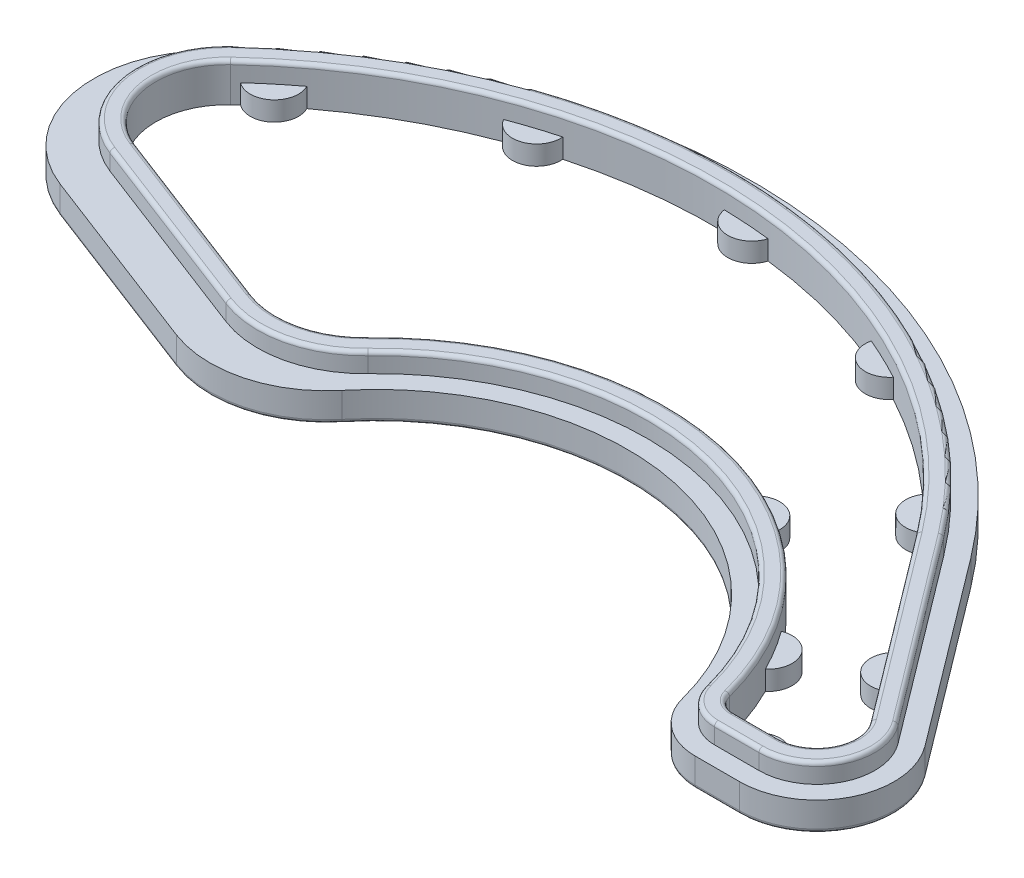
ISO-10303-21;
HEADER;
FILE_DESCRIPTION(('STEP AP214'),'2;1');
FILE_NAME('part.step','',(''),(''),'','','');
FILE_SCHEMA(('AUTOMOTIVE_DESIGN { 1 0 10303 214 1 1 1 1 }'));
ENDSEC;
DATA;
#1=APPLICATION_CONTEXT('core data for automotive mechanical design processes');
#2=APPLICATION_PROTOCOL_DEFINITION('international standard','automotive_design',2000,#1);
#3=PRODUCT_CONTEXT('',#1,'mechanical');
#4=PRODUCT('Part','Part','',(#3));
#5=PRODUCT_RELATED_PRODUCT_CATEGORY('part','',(#4));
#6=PRODUCT_DEFINITION_FORMATION('','',#4);
#7=PRODUCT_DEFINITION_CONTEXT('part definition',#1,'design');
#8=PRODUCT_DEFINITION('design','',#6,#7);
#9=PRODUCT_DEFINITION_SHAPE('','',#8);
#10=(LENGTH_UNIT() NAMED_UNIT(*) SI_UNIT(.MILLI.,.METRE.));
#11=(NAMED_UNIT(*) PLANE_ANGLE_UNIT() SI_UNIT($,.RADIAN.));
#12=(NAMED_UNIT(*) SI_UNIT($,.STERADIAN.) SOLID_ANGLE_UNIT());
#13=UNCERTAINTY_MEASURE_WITH_UNIT(LENGTH_MEASURE(1.E-05),#10,'distance_accuracy_value','');
#14=(GEOMETRIC_REPRESENTATION_CONTEXT(3) GLOBAL_UNCERTAINTY_ASSIGNED_CONTEXT((#13)) GLOBAL_UNIT_ASSIGNED_CONTEXT((#10,
#11,#12)) REPRESENTATION_CONTEXT('',''));
#15=CARTESIAN_POINT('',(0.,0.,0.));
#16=DIRECTION('',(0.,0.,1.));
#17=DIRECTION('',(1.,0.,0.));
#18=AXIS2_PLACEMENT_3D('',#15,#16,#17);
#19=CARTESIAN_POINT('',(-15.6525257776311,1.,-6.3133151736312));
#20=DIRECTION('',(0.,1.,0.));
#21=DIRECTION('',(0.,0.,1.));
#22=AXIS2_PLACEMENT_3D('',#19,#20,#21);
#23=PLANE('',#22);
#24=CARTESIAN_POINT('',(-15.6525257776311,1.,-6.3133151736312));
#25=DIRECTION('',(0.,1.,0.));
#26=DIRECTION('',(0.,0.,1.));
#27=AXIS2_PLACEMENT_3D('',#24,#25,#26);
#28=CIRCLE('',#27,6.00000000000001);
#29=CARTESIAN_POINT('',(-19.8734316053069,1.,-10.5775799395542));
#30=VERTEX_POINT('',#29);
#31=CARTESIAN_POINT('',(-17.8027334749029,1.,-0.711832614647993));
#32=VERTEX_POINT('',#31);
#33=EDGE_CURVE('E1136',#30,#32,#28,.T.);
#34=ORIENTED_EDGE('',*,*,#33,.T.);
#35=DIRECTION('',(0.933580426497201,0.,0.358367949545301));
#36=VECTOR('',#35,1.);
#37=CARTESIAN_POINT('',(-17.8027334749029,1.,-0.711832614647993));
#38=LINE('',#37,#36);
#39=CARTESIAN_POINT('',(-8.030360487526,1.,3.03942991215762));
#40=VERTEX_POINT('',#39);
#41=EDGE_CURVE('E1139',#32,#40,#38,.T.);
#42=ORIENTED_EDGE('',*,*,#41,.T.);
#43=CARTESIAN_POINT('',(-5.88015279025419,1.,-2.56205264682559));
#44=DIRECTION('',(0.,1.,0.));
#45=DIRECTION('',(0.,0.,1.));
#46=AXIS2_PLACEMENT_3D('',#43,#44,#45);
#47=CIRCLE('',#46,6.);
#48=CARTESIAN_POINT('',(-1.24431506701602,1.,1.2470166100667));
#49=VERTEX_POINT('',#48);
#50=EDGE_CURVE('E1141',#40,#49,#47,.T.);
#51=ORIENTED_EDGE('',*,*,#50,.T.);
#52=CARTESIAN_POINT('',(8.8,1.,9.5));
#53=DIRECTION('',(0.,-1.,0.));
#54=DIRECTION('',(0.,0.,1.));
#55=AXIS2_PLACEMENT_3D('',#52,#53,#54);
#56=CIRCLE('',#55,13.);
#57=CARTESIAN_POINT('',(21.3871958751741,1.,6.25));
#58=VERTEX_POINT('',#57);
#59=EDGE_CURVE('E1143',#49,#58,#56,.T.);
#60=ORIENTED_EDGE('',*,*,#59,.T.);
#61=CARTESIAN_POINT('',(24.2919333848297,1.,5.5));
#62=DIRECTION('',(0.,1.,0.));
#63=DIRECTION('',(0.,0.,1.));
#64=AXIS2_PLACEMENT_3D('',#61,#62,#63);
#65=CIRCLE('',#64,3.);
#66=CARTESIAN_POINT('',(24.2919333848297,1.,8.5));
#67=VERTEX_POINT('',#66);
#68=EDGE_CURVE('E1145',#58,#67,#65,.T.);
#69=ORIENTED_EDGE('',*,*,#68,.T.);
#70=DIRECTION('',(1.,0.,0.));
#71=VECTOR('',#70,1.);
#72=CARTESIAN_POINT('',(24.2919333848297,1.,8.5));
#73=LINE('',#72,#71);
#74=CARTESIAN_POINT('',(26.5965194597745,1.,8.5));
#75=VERTEX_POINT('',#74);
#76=EDGE_CURVE('E1147',#67,#75,#73,.T.);
#77=ORIENTED_EDGE('',*,*,#76,.T.);
#78=CARTESIAN_POINT('',(26.5965194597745,1.,4.5));
#79=DIRECTION('',(0.,1.,0.));
#80=DIRECTION('',(0.,0.,1.));
#81=AXIS2_PLACEMENT_3D('',#78,#79,#80);
#82=CIRCLE('',#81,4.);
#83=CARTESIAN_POINT('',(29.7910614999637,1.,2.0927399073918));
#84=VERTEX_POINT('',#83);
#85=EDGE_CURVE('E1149',#75,#84,#82,.T.);
#86=ORIENTED_EDGE('',*,*,#85,.T.);
#87=DIRECTION('',(-0.601815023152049,0.,-0.798635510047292));
#88=VECTOR('',#87,1.);
#89=CARTESIAN_POINT('',(29.7910614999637,1.,2.0927399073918));
#90=LINE('',#89,#88);
#91=CARTESIAN_POINT('',(22.561453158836,1.,-7.5012744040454));
#92=VERTEX_POINT('',#91);
#93=EDGE_CURVE('E1151',#84,#92,#90,.T.);
#94=ORIENTED_EDGE('',*,*,#93,.T.);
#95=CARTESIAN_POINT('',(0.,1.,9.5));
#96=DIRECTION('',(0.,1.,0.));
#97=DIRECTION('',(0.,0.,1.));
#98=AXIS2_PLACEMENT_3D('',#95,#96,#97);
#99=CIRCLE('',#98,28.25);
#100=EDGE_CURVE('E1153',#92,#30,#99,.T.);
#101=ORIENTED_EDGE('',*,*,#100,.T.);
#102=EDGE_LOOP('',(#34,#42,#51,#60,#69,#77,#86,#94,#101));
#103=FACE_BOUND('',#102,.T.);
#104=DIRECTION('',(-1.,0.,0.));
#105=VECTOR('',#104,1.);
#106=CARTESIAN_POINT('',(-15.6525257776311,1.,7.49999999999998));
#107=LINE('',#106,#105);
#108=CARTESIAN_POINT('',(26.5965194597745,1.,7.5));
#109=VERTEX_POINT('',#108);
#110=CARTESIAN_POINT('',(24.2919333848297,1.,7.5));
#111=VERTEX_POINT('',#110);
#112=EDGE_CURVE('E923',#109,#111,#107,.T.);
#113=ORIENTED_EDGE('',*,*,#112,.T.);
#114=CARTESIAN_POINT('',(24.2919333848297,1.,5.5));
#115=DIRECTION('',(0.,1.,0.));
#116=DIRECTION('',(0.,0.,1.));
#117=AXIS2_PLACEMENT_3D('',#114,#115,#116);
#118=CIRCLE('',#117,2.);
#119=CARTESIAN_POINT('',(22.355441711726,1.,5.99999999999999));
#120=VERTEX_POINT('',#119);
#121=EDGE_CURVE('E944',#111,#120,#118,.F.);
#122=ORIENTED_EDGE('',*,*,#121,.T.);
#123=CARTESIAN_POINT('',(8.8,1.,9.5));
#124=DIRECTION('',(0.,1.,0.));
#125=DIRECTION('',(0.,0.,1.));
#126=AXIS2_PLACEMENT_3D('',#123,#124,#125);
#127=CIRCLE('',#126,14.);
#128=CARTESIAN_POINT('',(-1.32131500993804,1.,-0.17258923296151));
#129=VERTEX_POINT('',#128);
#130=EDGE_CURVE('E534',#120,#129,#127,.T.);
#131=ORIENTED_EDGE('',*,*,#130,.T.);
#132=CARTESIAN_POINT('',(-5.32766886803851,1.,-4.00132247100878));
#133=DIRECTION('',(0.,1.,0.));
#134=DIRECTION('',(0.,0.,1.));
#135=AXIS2_PLACEMENT_3D('',#132,#133,#134);
#136=CIRCLE('',#135,5.54166666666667);
#137=CARTESIAN_POINT('',(-7.3136245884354,1.,1.17226905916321));
#138=VERTEX_POINT('',#137);
#139=EDGE_CURVE('E942',#129,#138,#136,.F.);
#140=ORIENTED_EDGE('',*,*,#139,.T.);
#141=DIRECTION('',(-0.933580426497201,0.,-0.358367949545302));
#142=VECTOR('',#141,1.);
#143=CARTESIAN_POINT('',(-17.0859975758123,1.,-2.5789934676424));
#144=LINE('',#143,#142);
#145=CARTESIAN_POINT('',(-17.0859975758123,1.,-2.5789934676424));
#146=VERTEX_POINT('',#145);
#147=EDGE_CURVE('E2621',#138,#146,#144,.T.);
#148=ORIENTED_EDGE('',*,*,#147,.T.);
#149=CARTESIAN_POINT('',(-15.4009222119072,1.,-6.96876487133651));
#150=DIRECTION('',(0.,1.,0.));
#151=DIRECTION('',(0.,0.,1.));
#152=AXIS2_PLACEMENT_3D('',#149,#150,#151);
#153=CIRCLE('',#152,4.70208166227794);
#154=CARTESIAN_POINT('',(-18.6125887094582,1.,-10.4031163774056));
#155=VERTEX_POINT('',#154);
#156=EDGE_CURVE('E2623',#146,#155,#153,.F.);
#157=ORIENTED_EDGE('',*,*,#156,.T.);
#158=CARTESIAN_POINT('',(0.,1.,9.5));
#159=DIRECTION('',(0.,1.,0.));
#160=DIRECTION('',(0.,0.,1.));
#161=AXIS2_PLACEMENT_3D('',#158,#159,#160);
#162=CIRCLE('',#161,27.25);
#163=CARTESIAN_POINT('',(21.7628176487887,1.,-6.89945938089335));
#164=VERTEX_POINT('',#163);
#165=EDGE_CURVE('E2628',#155,#164,#162,.F.);
#166=ORIENTED_EDGE('',*,*,#165,.T.);
#167=DIRECTION('',(0.601815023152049,0.,0.798635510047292));
#168=VECTOR('',#167,1.);
#169=CARTESIAN_POINT('',(8.49339808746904,1.,-24.5085738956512));
#170=LINE('',#169,#168);
#171=CARTESIAN_POINT('',(28.9924259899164,1.,2.69455493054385));
#172=VERTEX_POINT('',#171);
#173=EDGE_CURVE('E902',#164,#172,#170,.T.);
#174=ORIENTED_EDGE('',*,*,#173,.T.);
#175=CARTESIAN_POINT('',(26.5965194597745,1.,4.5));
#176=DIRECTION('',(0.,1.,0.));
#177=DIRECTION('',(0.,0.,1.));
#178=AXIS2_PLACEMENT_3D('',#175,#176,#177);
#179=CIRCLE('',#178,3.);
#180=EDGE_CURVE('E950',#172,#109,#179,.F.);
#181=ORIENTED_EDGE('',*,*,#180,.T.);
#182=EDGE_LOOP('',(#113,#122,#131,#140,#148,#157,#166,#174,#181));
#183=FACE_BOUND('',#182,.T.);
#184=ADVANCED_FACE('F39',(#103,#183),#23,.T.);
#185=DIRECTION('',(-1.,0.,0.));
#186=VECTOR('',#185,1.);
#187=CARTESIAN_POINT('',(-15.6525257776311,1.,6.49999999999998));
#188=LINE('',#187,#186);
#189=CARTESIAN_POINT('',(26.5965194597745,1.,6.5));
#190=VERTEX_POINT('',#189);
#191=CARTESIAN_POINT('',(24.4752551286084,1.,6.5));
#192=VERTEX_POINT('',#191);
#193=EDGE_CURVE('E548',#190,#192,#188,.T.);
#194=ORIENTED_EDGE('',*,*,#193,.F.);
#195=CARTESIAN_POINT('',(26.5965194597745,1.,4.5));
#196=DIRECTION('',(0.,1.,0.));
#197=DIRECTION('',(0.,0.,1.));
#198=AXIS2_PLACEMENT_3D('',#195,#196,#197);
#199=CIRCLE('',#198,2.);
#200=CARTESIAN_POINT('',(26.9191065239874,1.,6.47381295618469));
#201=VERTEX_POINT('',#200);
#202=EDGE_CURVE('E553',#201,#190,#199,.F.);
#203=ORIENTED_EDGE('',*,*,#202,.F.);
#204=CARTESIAN_POINT('',(25.7,1.,6.75));
#205=DIRECTION('',(0.,1.,0.));
#206=DIRECTION('',(0.,0.,1.));
#207=AXIS2_PLACEMENT_3D('',#204,#205,#206);
#208=CIRCLE('',#207,1.25);
#209=EDGE_CURVE('E597',#201,#192,#208,.T.);
#210=ORIENTED_EDGE('',*,*,#209,.T.);
#211=EDGE_LOOP('',(#194,#203,#210));
#212=FACE_BOUND('',#211,.T.);
#213=ADVANCED_FACE('F595',(#212),#23,.T.);
#214=DIRECTION('',(0.601815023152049,0.,0.798635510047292));
#215=VECTOR('',#214,1.);
#216=CARTESIAN_POINT('',(7.69476257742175,1.,-23.9067588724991));
#217=LINE('',#216,#215);
#218=CARTESIAN_POINT('',(24.7632712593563,1.,-1.25608281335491));
#219=VERTEX_POINT('',#218);
#220=CARTESIAN_POINT('',(26.2374109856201,1.,0.700166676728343));
#221=VERTEX_POINT('',#220);
#222=EDGE_CURVE('E558',#219,#221,#217,.T.);
#223=ORIENTED_EDGE('',*,*,#222,.F.);
#224=CARTESIAN_POINT('',(25.7,1.,-0.428411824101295));
#225=DIRECTION('',(0.,1.,0.));
#226=DIRECTION('',(0.,0.,1.));
#227=AXIS2_PLACEMENT_3D('',#224,#225,#226);
#228=CIRCLE('',#227,1.25);
#229=EDGE_CURVE('E1017',#219,#221,#228,.T.);
#230=ORIENTED_EDGE('',*,*,#229,.T.);
#231=EDGE_LOOP('',(#223,#230));
#232=FACE_BOUND('',#231,.T.);
#233=ADVANCED_FACE('F1276',(#232),#23,.T.);
#234=CARTESIAN_POINT('',(0.,1.,9.5));
#235=DIRECTION('',(0.,1.,0.));
#236=DIRECTION('',(0.,0.,1.));
#237=AXIS2_PLACEMENT_3D('',#234,#235,#236);
#238=CIRCLE('',#237,26.25);
#239=CARTESIAN_POINT('',(-17.6623655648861,1.,-9.91914886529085));
#240=VERTEX_POINT('',#239);
#241=CARTESIAN_POINT('',(-15.7851562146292,1.,-11.4735868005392));
#242=VERTEX_POINT('',#241);
#243=EDGE_CURVE('E567',#240,#242,#238,.F.);
#244=ORIENTED_EDGE('',*,*,#243,.F.);
#245=CARTESIAN_POINT('',(-16.9012571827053,1.,-10.9107203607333));
#246=DIRECTION('',(0.,1.,0.));
#247=DIRECTION('',(0.,0.,1.));
#248=AXIS2_PLACEMENT_3D('',#245,#246,#247);
#249=CIRCLE('',#248,1.25);
#250=EDGE_CURVE('E980',#240,#242,#249,.T.);
#251=ORIENTED_EDGE('',*,*,#250,.T.);
#252=EDGE_LOOP('',(#244,#251));
#253=FACE_BOUND('',#252,.T.);
#254=ADVANCED_FACE('F1440',(#253),#23,.T.);
#255=CARTESIAN_POINT('',(-9.20844902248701,1.,-15.0818422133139));
#256=VERTEX_POINT('',#255);
#257=CARTESIAN_POINT('',(-6.88885179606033,1.,-15.8299471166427));
#258=VERTEX_POINT('',#257);
#259=EDGE_CURVE('E563',#256,#258,#238,.F.);
#260=ORIENTED_EDGE('',*,*,#259,.F.);
#261=CARTESIAN_POINT('',(-8.13407411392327,1.,-15.7207620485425));
#262=DIRECTION('',(0.,1.,0.));
#263=DIRECTION('',(0.,0.,1.));
#264=AXIS2_PLACEMENT_3D('',#261,#262,#263);
#265=CIRCLE('',#264,1.25);
#266=EDGE_CURVE('E1006',#256,#258,#265,.T.);
#267=ORIENTED_EDGE('',*,*,#266,.T.);
#268=EDGE_LOOP('',(#260,#267));
#269=FACE_BOUND('',#268,.T.);
#270=ADVANCED_FACE('F1879',(#269),#23,.T.);
#271=CARTESIAN_POINT('',(0.556745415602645,1.,-16.7440952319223));
#272=VERTEX_POINT('',#271);
#273=CARTESIAN_POINT('',(2.98842119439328,1.,-16.5793373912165));
#274=VERTEX_POINT('',#273);
#275=EDGE_CURVE('E566',#272,#274,#238,.F.);
#276=ORIENTED_EDGE('',*,*,#275,.F.);
#277=CARTESIAN_POINT('',(1.79139647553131,1.,-16.9393815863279));
#278=DIRECTION('',(0.,1.,0.));
#279=DIRECTION('',(0.,0.,1.));
#280=AXIS2_PLACEMENT_3D('',#277,#278,#279);
#281=CIRCLE('',#280,1.25);
#282=EDGE_CURVE('E1020',#272,#274,#281,.T.);
#283=ORIENTED_EDGE('',*,*,#282,.T.);
#284=EDGE_LOOP('',(#276,#283));
#285=FACE_BOUND('',#284,.T.);
#286=ADVANCED_FACE('F1839',(#285),#23,.T.);
#287=CARTESIAN_POINT('',(10.2426596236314,1.,-14.6692040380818));
#288=VERTEX_POINT('',#287);
#289=CARTESIAN_POINT('',(12.4401447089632,1.,-13.6150448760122));
#290=VERTEX_POINT('',#289);
#291=EDGE_CURVE('E1430',#288,#290,#238,.F.);
#292=ORIENTED_EDGE('',*,*,#291,.F.);
#293=CARTESIAN_POINT('',(11.4617732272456,1.,-14.3930482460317));
#294=DIRECTION('',(0.,1.,0.));
#295=DIRECTION('',(0.,0.,1.));
#296=AXIS2_PLACEMENT_3D('',#293,#294,#295);
#297=CIRCLE('',#296,1.25);
#298=EDGE_CURVE('E1033',#288,#290,#297,.T.);
#299=ORIENTED_EDGE('',*,*,#298,.T.);
#300=EDGE_LOOP('',(#292,#299));
#301=FACE_BOUND('',#300,.T.);
#302=ADVANCED_FACE('F1434',(#301),#23,.T.);
#303=CARTESIAN_POINT('',(18.4700249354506,1.,-9.15263195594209));
#304=VERTEX_POINT('',#303);
#305=CARTESIAN_POINT('',(20.1203987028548,1.,-7.35918313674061));
#306=VERTEX_POINT('',#305);
#307=EDGE_CURVE('E1435',#304,#306,#238,.F.);
#308=ORIENTED_EDGE('',*,*,#307,.F.);
#309=CARTESIAN_POINT('',(19.5,1.,-8.44435844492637));
#310=DIRECTION('',(0.,1.,0.));
#311=DIRECTION('',(0.,0.,1.));
#312=AXIS2_PLACEMENT_3D('',#309,#310,#311);
#313=CIRCLE('',#312,1.25);
#314=EDGE_CURVE('E1044',#304,#306,#313,.T.);
#315=ORIENTED_EDGE('',*,*,#314,.T.);
#316=EDGE_LOOP('',(#308,#315));
#317=FACE_BOUND('',#316,.T.);
#318=ADVANCED_FACE('F1757',(#317),#23,.T.);
#319=CARTESIAN_POINT('',(8.8,1.,9.5));
#320=DIRECTION('',(0.,1.,0.));
#321=DIRECTION('',(0.,0.,1.));
#322=AXIS2_PLACEMENT_3D('',#319,#320,#321);
#323=CIRCLE('',#322,15.);
#324=CARTESIAN_POINT('',(22.2148754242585,1.,2.78873206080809));
#325=VERTEX_POINT('',#324);
#326=CARTESIAN_POINT('',(20.9327732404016,1.,0.679806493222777));
#327=VERTEX_POINT('',#326);
#328=EDGE_CURVE('E543',#325,#327,#323,.T.);
#329=ORIENTED_EDGE('',*,*,#328,.F.);
#330=CARTESIAN_POINT('',(21.4036515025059,1.,1.8377243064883));
#331=DIRECTION('',(0.,1.,0.));
#332=DIRECTION('',(0.,0.,1.));
#333=AXIS2_PLACEMENT_3D('',#330,#331,#332);
#334=CIRCLE('',#333,1.25);
#335=EDGE_CURVE('E1054',#325,#327,#334,.T.);
#336=ORIENTED_EDGE('',*,*,#335,.T.);
#337=EDGE_LOOP('',(#329,#336));
#338=FACE_BOUND('',#337,.T.);
#339=ADVANCED_FACE('F1300',(#338),#23,.T.);
#340=CARTESIAN_POINT('',(16.2839248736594,1.,-3.49964878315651));
#341=VERTEX_POINT('',#340);
#342=CARTESIAN_POINT('',(14.0509372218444,1.,-4.55089528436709));
#343=VERTEX_POINT('',#342);
#344=EDGE_CURVE('E541',#341,#343,#323,.T.);
#345=ORIENTED_EDGE('',*,*,#344,.F.);
#346=CARTESIAN_POINT('',(15.082604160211,1.,-3.84508842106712));
#347=DIRECTION('',(0.,1.,0.));
#348=DIRECTION('',(0.,0.,1.));
#349=AXIS2_PLACEMENT_3D('',#346,#347,#348);
#350=CIRCLE('',#349,1.25000000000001);
#351=EDGE_CURVE('E1074',#341,#343,#350,.T.);
#352=ORIENTED_EDGE('',*,*,#351,.T.);
#353=EDGE_LOOP('',(#345,#352));
#354=FACE_BOUND('',#353,.T.);
#355=ADVANCED_FACE('F1291',(#354),#23,.T.);
#356=CARTESIAN_POINT('',(7.86764908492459,1.,-5.47099601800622));
#357=VERTEX_POINT('',#356);
#358=CARTESIAN_POINT('',(5.42532544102,1.,-5.11545659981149));
#359=VERTEX_POINT('',#358);
#360=EDGE_CURVE('E545',#357,#359,#323,.T.);
#361=ORIENTED_EDGE('',*,*,#360,.F.);
#362=CARTESIAN_POINT('',(6.67517634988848,1.,-5.09615101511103));
#363=DIRECTION('',(0.,1.,0.));
#364=DIRECTION('',(0.,0.,1.));
#365=AXIS2_PLACEMENT_3D('',#362,#363,#364);
#366=CIRCLE('',#365,1.25);
#367=EDGE_CURVE('E1063',#357,#359,#366,.T.);
#368=ORIENTED_EDGE('',*,*,#367,.T.);
#369=EDGE_LOOP('',(#361,#368));
#370=FACE_BOUND('',#369,.T.);
#371=ADVANCED_FACE('F1281',(#370),#23,.T.);
#372=CARTESIAN_POINT('',(28.1937904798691,1.,3.2963699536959));
#373=DIRECTION('',(-0.798635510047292,0.,0.601815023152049));
#374=DIRECTION('',(0.601815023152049,0.,0.798635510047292));
#375=AXIS2_PLACEMENT_3D('',#372,#373,#374);
#376=PLANE('',#375);
#377=DIRECTION('',(0.,-1.,0.));
#378=VECTOR('',#377,1.);
#379=CARTESIAN_POINT('',(28.1937904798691,1.,3.2963699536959));
#380=LINE('',#379,#378);
#381=CARTESIAN_POINT('',(28.1937904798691,1.8,3.2963699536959));
#382=VERTEX_POINT('',#381);
#383=CARTESIAN_POINT('',(28.1937904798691,0.,3.2963699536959));
#384=VERTEX_POINT('',#383);
#385=EDGE_CURVE('E1126',#382,#384,#380,.T.);
#386=ORIENTED_EDGE('',*,*,#385,.F.);
#387=DIRECTION('',(-0.601815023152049,0.,-0.798635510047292));
#388=VECTOR('',#387,1.);
#389=CARTESIAN_POINT('',(28.1937904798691,1.8,3.2963699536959));
#390=LINE('',#389,#388);
#391=CARTESIAN_POINT('',(20.9641821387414,1.8,-6.2976443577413));
#392=VERTEX_POINT('',#391);
#393=EDGE_CURVE('E699',#382,#392,#390,.T.);
#394=ORIENTED_EDGE('',*,*,#393,.T.);
#395=DIRECTION('',(0.,-1.,0.));
#396=VECTOR('',#395,1.);
#397=CARTESIAN_POINT('',(20.9641821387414,1.,-6.2976443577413));
#398=LINE('',#397,#396);
#399=CARTESIAN_POINT('',(20.9641821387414,0.,-6.2976443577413));
#400=VERTEX_POINT('',#399);
#401=EDGE_CURVE('E1124',#392,#400,#398,.T.);
#402=ORIENTED_EDGE('',*,*,#401,.T.);
#403=DIRECTION('',(-0.601815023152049,0.,-0.798635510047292));
#404=VECTOR('',#403,1.);
#405=CARTESIAN_POINT('',(28.1937904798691,0.,3.2963699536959));
#406=LINE('',#405,#404);
#407=CARTESIAN_POINT('',(24.7632712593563,0.,-1.25608281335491));
#408=VERTEX_POINT('',#407);
#409=EDGE_CURVE('E1113',#408,#400,#406,.T.);
#410=ORIENTED_EDGE('',*,*,#409,.F.);
#411=DIRECTION('',(0.,-1.,0.));
#412=VECTOR('',#411,1.);
#413=CARTESIAN_POINT('',(24.7632712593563,1.,-1.25608281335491));
#414=LINE('',#413,#412);
#415=EDGE_CURVE('E620',#408,#219,#414,.F.);
#416=ORIENTED_EDGE('',*,*,#415,.T.);
#417=ORIENTED_EDGE('',*,*,#222,.T.);
#418=DIRECTION('',(0.,-1.,0.));
#419=VECTOR('',#418,1.);
#420=CARTESIAN_POINT('',(26.2374109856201,1.,0.700166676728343));
#421=LINE('',#420,#419);
#422=CARTESIAN_POINT('',(26.2374109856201,0.,0.700166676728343));
#423=VERTEX_POINT('',#422);
#424=EDGE_CURVE('E617',#221,#423,#421,.T.);
#425=ORIENTED_EDGE('',*,*,#424,.T.);
#426=EDGE_CURVE('E1114',#384,#423,#406,.T.);
#427=ORIENTED_EDGE('',*,*,#426,.F.);
#428=EDGE_LOOP('',(#386,#394,#402,#410,#416,#417,#425,#427));
#429=FACE_BOUND('',#428,.T.);
#430=ADVANCED_FACE('F1290',(#429),#376,.T.);
#431=CARTESIAN_POINT('',(0.,1.,9.5));
#432=DIRECTION('',(0.,-1.,0.));
#433=DIRECTION('',(0.,0.,-1.));
#434=AXIS2_PLACEMENT_3D('',#431,#432,#433);
#435=CYLINDRICAL_SURFACE('',#434,26.25);
#436=ORIENTED_EDGE('',*,*,#401,.F.);
#437=CARTESIAN_POINT('',(0.,1.8,9.5));
#438=DIRECTION('',(0.,1.,0.));
#439=DIRECTION('',(0.,0.,1.));
#440=AXIS2_PLACEMENT_3D('',#437,#438,#439);
#441=CIRCLE('',#440,26.25);
#442=CARTESIAN_POINT('',(-17.9295579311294,1.8,-9.6727267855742));
#443=VERTEX_POINT('',#442);
#444=EDGE_CURVE('E48',#392,#443,#441,.T.);
#445=ORIENTED_EDGE('',*,*,#444,.T.);
#446=DIRECTION('',(0.,-1.,0.));
#447=VECTOR('',#446,1.);
#448=CARTESIAN_POINT('',(-17.9295579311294,1.,-9.6727267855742));
#449=LINE('',#448,#447);
#450=CARTESIAN_POINT('',(-17.9295579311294,0.,-9.6727267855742));
#451=VERTEX_POINT('',#450);
#452=EDGE_CURVE('E1121',#443,#451,#449,.T.);
#453=ORIENTED_EDGE('',*,*,#452,.T.);
#454=CARTESIAN_POINT('',(0.,0.,9.5));
#455=DIRECTION('',(0.,1.,0.));
#456=DIRECTION('',(0.,0.,1.));
#457=AXIS2_PLACEMENT_3D('',#454,#455,#456);
#458=CIRCLE('',#457,26.25);
#459=CARTESIAN_POINT('',(-17.6623655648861,0.,-9.91914886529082));
#460=VERTEX_POINT('',#459);
#461=EDGE_CURVE('E1117',#460,#451,#458,.T.);
#462=ORIENTED_EDGE('',*,*,#461,.F.);
#463=DIRECTION('',(0.,-1.,0.));
#464=VECTOR('',#463,1.);
#465=CARTESIAN_POINT('',(-17.6623655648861,0.5,-9.91914886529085));
#466=LINE('',#465,#464);
#467=EDGE_CURVE('E998',#460,#240,#466,.F.);
#468=ORIENTED_EDGE('',*,*,#467,.T.);
#469=ORIENTED_EDGE('',*,*,#243,.T.);
#470=DIRECTION('',(0.,-1.,0.));
#471=VECTOR('',#470,1.);
#472=CARTESIAN_POINT('',(-15.7851562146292,0.5,-11.4735868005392));
#473=LINE('',#472,#471);
#474=CARTESIAN_POINT('',(-15.7851562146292,0.,-11.4735868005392));
#475=VERTEX_POINT('',#474);
#476=EDGE_CURVE('E1003',#242,#475,#473,.T.);
#477=ORIENTED_EDGE('',*,*,#476,.T.);
#478=CARTESIAN_POINT('',(-9.20844902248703,0.,-15.0818422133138));
#479=VERTEX_POINT('',#478);
#480=EDGE_CURVE('E1415',#479,#475,#458,.T.);
#481=ORIENTED_EDGE('',*,*,#480,.F.);
#482=DIRECTION('',(0.,-1.,0.));
#483=VECTOR('',#482,1.);
#484=CARTESIAN_POINT('',(-9.20844902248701,0.5,-15.0818422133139));
#485=LINE('',#484,#483);
#486=EDGE_CURVE('E1009',#479,#256,#485,.F.);
#487=ORIENTED_EDGE('',*,*,#486,.T.);
#488=ORIENTED_EDGE('',*,*,#259,.T.);
#489=DIRECTION('',(0.,-1.,0.));
#490=VECTOR('',#489,1.);
#491=CARTESIAN_POINT('',(-6.88885179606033,0.5,-15.8299471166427));
#492=LINE('',#491,#490);
#493=CARTESIAN_POINT('',(-6.88885179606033,0.,-15.8299471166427));
#494=VERTEX_POINT('',#493);
#495=EDGE_CURVE('E1014',#258,#494,#492,.T.);
#496=ORIENTED_EDGE('',*,*,#495,.T.);
#497=CARTESIAN_POINT('',(0.556745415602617,0.,-16.7440952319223));
#498=VERTEX_POINT('',#497);
#499=EDGE_CURVE('E1416',#498,#494,#458,.T.);
#500=ORIENTED_EDGE('',*,*,#499,.F.);
#501=DIRECTION('',(0.,-1.,0.));
#502=VECTOR('',#501,1.);
#503=CARTESIAN_POINT('',(0.556745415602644,0.5,-16.7440952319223));
#504=LINE('',#503,#502);
#505=EDGE_CURVE('E1025',#498,#272,#504,.F.);
#506=ORIENTED_EDGE('',*,*,#505,.T.);
#507=ORIENTED_EDGE('',*,*,#275,.T.);
#508=DIRECTION('',(0.,-1.,0.));
#509=VECTOR('',#508,1.);
#510=CARTESIAN_POINT('',(2.98842119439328,0.5,-16.5793373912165));
#511=LINE('',#510,#509);
#512=CARTESIAN_POINT('',(2.98842119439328,0.,-16.5793373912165));
#513=VERTEX_POINT('',#512);
#514=EDGE_CURVE('E1030',#274,#513,#511,.T.);
#515=ORIENTED_EDGE('',*,*,#514,.T.);
#516=CARTESIAN_POINT('',(10.2426596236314,0.,-14.6692040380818));
#517=VERTEX_POINT('',#516);
#518=EDGE_CURVE('E1419',#517,#513,#458,.T.);
#519=ORIENTED_EDGE('',*,*,#518,.F.);
#520=DIRECTION('',(0.,-1.,0.));
#521=VECTOR('',#520,1.);
#522=CARTESIAN_POINT('',(10.2426596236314,0.5,-14.6692040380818));
#523=LINE('',#522,#521);
#524=EDGE_CURVE('E1036',#517,#288,#523,.F.);
#525=ORIENTED_EDGE('',*,*,#524,.T.);
#526=ORIENTED_EDGE('',*,*,#291,.T.);
#527=DIRECTION('',(0.,-1.,0.));
#528=VECTOR('',#527,1.);
#529=CARTESIAN_POINT('',(12.4401447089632,0.5,-13.6150448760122));
#530=LINE('',#529,#528);
#531=CARTESIAN_POINT('',(12.4401447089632,0.,-13.6150448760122));
#532=VERTEX_POINT('',#531);
#533=EDGE_CURVE('E1041',#290,#532,#530,.T.);
#534=ORIENTED_EDGE('',*,*,#533,.T.);
#535=CARTESIAN_POINT('',(18.4700249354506,0.,-9.15263195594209));
#536=VERTEX_POINT('',#535);
#537=EDGE_CURVE('E1122',#536,#532,#458,.T.);
#538=ORIENTED_EDGE('',*,*,#537,.F.);
#539=DIRECTION('',(0.,-1.,0.));
#540=VECTOR('',#539,1.);
#541=CARTESIAN_POINT('',(18.4700249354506,0.5,-9.1526319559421));
#542=LINE('',#541,#540);
#543=EDGE_CURVE('E606',#536,#304,#542,.F.);
#544=ORIENTED_EDGE('',*,*,#543,.T.);
#545=ORIENTED_EDGE('',*,*,#307,.T.);
#546=DIRECTION('',(0.,-1.,0.));
#547=VECTOR('',#546,1.);
#548=CARTESIAN_POINT('',(20.1203987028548,0.5,-7.35918313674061));
#549=LINE('',#548,#547);
#550=CARTESIAN_POINT('',(20.1203987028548,0.,-7.35918313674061));
#551=VERTEX_POINT('',#550);
#552=EDGE_CURVE('E609',#306,#551,#549,.T.);
#553=ORIENTED_EDGE('',*,*,#552,.T.);
#554=EDGE_CURVE('E1118',#400,#551,#458,.T.);
#555=ORIENTED_EDGE('',*,*,#554,.F.);
#556=EDGE_LOOP('',(#436,#445,#453,#462,#468,#469,#477,#481,#487,#488,#496,#500,#506,#507,#515,
#519,#525,#526,#534,#538,#544,#545,#553,#555));
#557=FACE_BOUND('',#556,.T.);
#558=ADVANCED_FACE('F1297',(#557),#435,.F.);
#559=CARTESIAN_POINT('',(24.2919333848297,1.,6.5));
#560=DIRECTION('',(0.,0.,-1.));
#561=DIRECTION('',(-1.,0.,0.));
#562=AXIS2_PLACEMENT_3D('',#559,#560,#561);
#563=PLANE('',#562);
#564=DIRECTION('',(0.,-1.,0.));
#565=VECTOR('',#564,1.);
#566=CARTESIAN_POINT('',(24.2919333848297,1.,6.5));
#567=LINE('',#566,#565);
#568=CARTESIAN_POINT('',(24.2919333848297,1.8,6.5));
#569=VERTEX_POINT('',#568);
#570=CARTESIAN_POINT('',(24.2919333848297,0.,6.5));
#571=VERTEX_POINT('',#570);
#572=EDGE_CURVE('E1128',#569,#571,#567,.T.);
#573=ORIENTED_EDGE('',*,*,#572,.F.);
#574=DIRECTION('',(1.,0.,0.));
#575=VECTOR('',#574,1.);
#576=CARTESIAN_POINT('',(24.2919333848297,1.8,6.5));
#577=LINE('',#576,#575);
#578=CARTESIAN_POINT('',(26.5965194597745,1.8,6.5));
#579=VERTEX_POINT('',#578);
#580=EDGE_CURVE('E590',#569,#579,#577,.T.);
#581=ORIENTED_EDGE('',*,*,#580,.T.);
#582=DIRECTION('',(0.,-1.,0.));
#583=VECTOR('',#582,1.);
#584=CARTESIAN_POINT('',(26.5965194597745,2.,6.5));
#585=LINE('',#584,#583);
#586=EDGE_CURVE('E525',#579,#190,#585,.T.);
#587=ORIENTED_EDGE('',*,*,#586,.T.);
#588=ORIENTED_EDGE('',*,*,#193,.T.);
#589=DIRECTION('',(0.,-1.,0.));
#590=VECTOR('',#589,1.);
#591=CARTESIAN_POINT('',(24.4752551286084,1.,6.5));
#592=LINE('',#591,#590);
#593=CARTESIAN_POINT('',(24.4752551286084,0.,6.5));
#594=VERTEX_POINT('',#593);
#595=EDGE_CURVE('E1051',#192,#594,#592,.T.);
#596=ORIENTED_EDGE('',*,*,#595,.T.);
#597=DIRECTION('',(1.,0.,0.));
#598=VECTOR('',#597,1.);
#599=CARTESIAN_POINT('',(24.2919333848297,0.,6.5));
#600=LINE('',#599,#598);
#601=EDGE_CURVE('E1109',#571,#594,#600,.T.);
#602=ORIENTED_EDGE('',*,*,#601,.F.);
#603=EDGE_LOOP('',(#573,#581,#587,#588,#596,#602));
#604=FACE_BOUND('',#603,.T.);
#605=ADVANCED_FACE('F588',(#604),#563,.T.);
#606=CARTESIAN_POINT('',(26.5965194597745,1.,4.5));
#607=DIRECTION('',(0.,-1.,0.));
#608=DIRECTION('',(0.,0.,-1.));
#609=AXIS2_PLACEMENT_3D('',#606,#607,#608);
#610=CYLINDRICAL_SURFACE('',#609,2.);
#611=ORIENTED_EDGE('',*,*,#586,.F.);
#612=CARTESIAN_POINT('',(26.5965194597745,1.8,4.5));
#613=DIRECTION('',(0.,1.,0.));
#614=DIRECTION('',(0.,0.,1.));
#615=AXIS2_PLACEMENT_3D('',#612,#613,#614);
#616=CIRCLE('',#615,2.);
#617=EDGE_CURVE('E790',#579,#382,#616,.T.);
#618=ORIENTED_EDGE('',*,*,#617,.T.);
#619=ORIENTED_EDGE('',*,*,#385,.T.);
#620=CARTESIAN_POINT('',(26.5965194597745,0.,4.5));
#621=DIRECTION('',(0.,1.,0.));
#622=DIRECTION('',(0.,0.,1.));
#623=AXIS2_PLACEMENT_3D('',#620,#621,#622);
#624=CIRCLE('',#623,2.);
#625=CARTESIAN_POINT('',(26.9191065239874,0.,6.47381295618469));
#626=VERTEX_POINT('',#625);
#627=EDGE_CURVE('E604',#626,#384,#624,.T.);
#628=ORIENTED_EDGE('',*,*,#627,.F.);
#629=DIRECTION('',(0.,-1.,0.));
#630=VECTOR('',#629,1.);
#631=CARTESIAN_POINT('',(26.9191065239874,0.5,6.47381295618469));
#632=LINE('',#631,#630);
#633=EDGE_CURVE('E602',#626,#201,#632,.F.);
#634=ORIENTED_EDGE('',*,*,#633,.T.);
#635=ORIENTED_EDGE('',*,*,#202,.T.);
#636=EDGE_LOOP('',(#611,#618,#619,#628,#634,#635));
#637=FACE_BOUND('',#636,.T.);
#638=ADVANCED_FACE('F599',(#637),#610,.F.);
#639=CARTESIAN_POINT('',(8.8,1.,9.5));
#640=DIRECTION('',(0.,-1.,0.));
#641=DIRECTION('',(0.,0.,-1.));
#642=AXIS2_PLACEMENT_3D('',#639,#640,#641);
#643=CYLINDRICAL_SURFACE('',#642,15.);
#644=DIRECTION('',(0.,-1.,0.));
#645=VECTOR('',#644,1.);
#646=CARTESIAN_POINT('',(-2.04426608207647,2.,-0.863488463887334));
#647=LINE('',#646,#645);
#648=CARTESIAN_POINT('',(-2.04426608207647,1.8,-0.863488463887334));
#649=VERTEX_POINT('',#648);
#650=CARTESIAN_POINT('',(-2.04426608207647,1.,-0.863488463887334));
#651=VERTEX_POINT('',#650);
#652=EDGE_CURVE('E514',#649,#651,#647,.T.);
#653=ORIENTED_EDGE('',*,*,#652,.F.);
#654=CARTESIAN_POINT('',(8.8,1.8,9.5));
#655=DIRECTION('',(0.,1.,0.));
#656=DIRECTION('',(0.,0.,1.));
#657=AXIS2_PLACEMENT_3D('',#654,#655,#656);
#658=CIRCLE('',#657,15.);
#659=CARTESIAN_POINT('',(23.3236875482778,1.8,5.74999999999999));
#660=VERTEX_POINT('',#659);
#661=EDGE_CURVE('E795',#649,#660,#658,.F.);
#662=ORIENTED_EDGE('',*,*,#661,.T.);
#663=DIRECTION('',(0.,-1.,0.));
#664=VECTOR('',#663,1.);
#665=CARTESIAN_POINT('',(23.3236875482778,1.,5.74999999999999));
#666=LINE('',#665,#664);
#667=CARTESIAN_POINT('',(23.3236875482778,0.,5.74999999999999));
#668=VERTEX_POINT('',#667);
#669=EDGE_CURVE('E1130',#660,#668,#666,.T.);
#670=ORIENTED_EDGE('',*,*,#669,.T.);
#671=CARTESIAN_POINT('',(8.8,0.,9.5));
#672=DIRECTION('',(0.,-1.,0.));
#673=DIRECTION('',(0.,0.,1.));
#674=AXIS2_PLACEMENT_3D('',#671,#672,#673);
#675=CIRCLE('',#674,15.);
#676=CARTESIAN_POINT('',(22.2148754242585,0.,2.78873206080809));
#677=VERTEX_POINT('',#676);
#678=EDGE_CURVE('E1100',#677,#668,#675,.T.);
#679=ORIENTED_EDGE('',*,*,#678,.F.);
#680=DIRECTION('',(0.,-1.,0.));
#681=VECTOR('',#680,1.);
#682=CARTESIAN_POINT('',(22.2148754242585,0.5,2.78873206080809));
#683=LINE('',#682,#681);
#684=EDGE_CURVE('E1061',#677,#325,#683,.F.);
#685=ORIENTED_EDGE('',*,*,#684,.T.);
#686=ORIENTED_EDGE('',*,*,#328,.T.);
#687=DIRECTION('',(0.,-1.,0.));
#688=VECTOR('',#687,1.);
#689=CARTESIAN_POINT('',(20.9327732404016,0.5,0.679806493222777));
#690=LINE('',#689,#688);
#691=CARTESIAN_POINT('',(20.9327732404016,0.,0.679806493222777));
#692=VERTEX_POINT('',#691);
#693=EDGE_CURVE('E1057',#327,#692,#690,.T.);
#694=ORIENTED_EDGE('',*,*,#693,.T.);
#695=CARTESIAN_POINT('',(16.2839248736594,0.,-3.49964878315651));
#696=VERTEX_POINT('',#695);
#697=EDGE_CURVE('E1106',#696,#692,#675,.T.);
#698=ORIENTED_EDGE('',*,*,#697,.F.);
#699=DIRECTION('',(0.,-1.,0.));
#700=VECTOR('',#699,1.);
#701=CARTESIAN_POINT('',(16.2839248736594,0.5,-3.49964878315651));
#702=LINE('',#701,#700);
#703=EDGE_CURVE('E1083',#696,#341,#702,.F.);
#704=ORIENTED_EDGE('',*,*,#703,.T.);
#705=ORIENTED_EDGE('',*,*,#344,.T.);
#706=DIRECTION('',(0.,-1.,0.));
#707=VECTOR('',#706,1.);
#708=CARTESIAN_POINT('',(14.0509372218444,0.5,-4.55089528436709));
#709=LINE('',#708,#707);
#710=CARTESIAN_POINT('',(14.0509372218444,0.,-4.55089528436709));
#711=VERTEX_POINT('',#710);
#712=EDGE_CURVE('E1078',#343,#711,#709,.T.);
#713=ORIENTED_EDGE('',*,*,#712,.T.);
#714=CARTESIAN_POINT('',(7.8676490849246,0.,-5.47099601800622));
#715=VERTEX_POINT('',#714);
#716=EDGE_CURVE('E1105',#715,#711,#675,.T.);
#717=ORIENTED_EDGE('',*,*,#716,.F.);
#718=DIRECTION('',(0.,-1.,0.));
#719=VECTOR('',#718,1.);
#720=CARTESIAN_POINT('',(7.86764908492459,0.5,-5.47099601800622));
#721=LINE('',#720,#719);
#722=EDGE_CURVE('E1071',#715,#357,#721,.F.);
#723=ORIENTED_EDGE('',*,*,#722,.T.);
#724=ORIENTED_EDGE('',*,*,#360,.T.);
#725=DIRECTION('',(0.,-1.,0.));
#726=VECTOR('',#725,1.);
#727=CARTESIAN_POINT('',(5.42532544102,0.5,-5.11545659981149));
#728=LINE('',#727,#726);
#729=CARTESIAN_POINT('',(5.42532544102,0.,-5.11545659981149));
#730=VERTEX_POINT('',#729);
#731=EDGE_CURVE('E1066',#359,#730,#728,.T.);
#732=ORIENTED_EDGE('',*,*,#731,.T.);
#733=CARTESIAN_POINT('',(-0.239003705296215,0.,-2.47064793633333));
#734=VERTEX_POINT('',#733);
#735=EDGE_CURVE('E1101',#734,#730,#675,.T.);
#736=ORIENTED_EDGE('',*,*,#735,.F.);
#737=DIRECTION('',(0.,-1.,0.));
#738=VECTOR('',#737,1.);
#739=CARTESIAN_POINT('',(-0.239003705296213,0.5,-2.47064793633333));
#740=LINE('',#739,#738);
#741=CARTESIAN_POINT('',(-0.239003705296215,1.,-2.47064793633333));
#742=VERTEX_POINT('',#741);
#743=EDGE_CURVE('E540',#734,#742,#740,.F.);
#744=ORIENTED_EDGE('',*,*,#743,.T.);
#745=EDGE_CURVE('E531',#742,#651,#323,.T.);
#746=ORIENTED_EDGE('',*,*,#745,.T.);
#747=EDGE_LOOP('',(#653,#662,#670,#679,#685,#686,#694,#698,#704,#705,#713,#717,#723,#724,#732,
#736,#744,#746));
#748=FACE_BOUND('',#747,.T.);
#749=ADVANCED_FACE('F537',(#748),#643,.T.);
#750=CARTESIAN_POINT('',(-5.32766886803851,1.,-4.00132247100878));
#751=DIRECTION('',(0.,-1.,0.));
#752=DIRECTION('',(0.,0.,-1.));
#753=AXIS2_PLACEMENT_3D('',#750,#751,#752);
#754=CYLINDRICAL_SURFACE('',#753,4.54166666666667);
#755=DIRECTION('',(0.,-1.,0.));
#756=VECTOR('',#755,1.);
#757=CARTESIAN_POINT('',(-6.95525663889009,1.,0.238688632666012));
#758=LINE('',#757,#756);
#759=CARTESIAN_POINT('',(-6.95525663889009,1.8,0.238688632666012));
#760=VERTEX_POINT('',#759);
#761=CARTESIAN_POINT('',(-6.95525663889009,0.,0.238688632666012));
#762=VERTEX_POINT('',#761);
#763=EDGE_CURVE('E1132',#760,#762,#758,.T.);
#764=ORIENTED_EDGE('',*,*,#763,.F.);
#765=CARTESIAN_POINT('',(-5.32766886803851,1.8,-4.00132247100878));
#766=DIRECTION('',(0.,1.,0.));
#767=DIRECTION('',(0.,0.,1.));
#768=AXIS2_PLACEMENT_3D('',#765,#766,#767);
#769=CIRCLE('',#768,4.54166666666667);
#770=EDGE_CURVE('E521',#760,#649,#769,.T.);
#771=ORIENTED_EDGE('',*,*,#770,.T.);
#772=ORIENTED_EDGE('',*,*,#652,.T.);
#773=CARTESIAN_POINT('',(-5.32766886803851,1.,-4.00132247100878));
#774=DIRECTION('',(0.,1.,0.));
#775=DIRECTION('',(0.,0.,1.));
#776=AXIS2_PLACEMENT_3D('',#773,#774,#775);
#777=CIRCLE('',#776,4.54166666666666);
#778=CARTESIAN_POINT('',(-2.07980394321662,1.,-0.826718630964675));
#779=VERTEX_POINT('',#778);
#780=EDGE_CURVE('E519',#651,#779,#777,.F.);
#781=ORIENTED_EDGE('',*,*,#780,.T.);
#782=DIRECTION('',(0.,-1.,0.));
#783=VECTOR('',#782,1.);
#784=CARTESIAN_POINT('',(-2.07980394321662,0.5,-0.826718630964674));
#785=LINE('',#784,#783);
#786=CARTESIAN_POINT('',(-2.07980394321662,0.,-0.826718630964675));
#787=VERTEX_POINT('',#786);
#788=EDGE_CURVE('E1088',#779,#787,#785,.T.);
#789=ORIENTED_EDGE('',*,*,#788,.T.);
#790=CARTESIAN_POINT('',(-5.32766886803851,0.,-4.00132247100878));
#791=DIRECTION('',(0.,1.,0.));
#792=DIRECTION('',(0.,0.,1.));
#793=AXIS2_PLACEMENT_3D('',#790,#791,#792);
#794=CIRCLE('',#793,4.54166666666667);
#795=EDGE_CURVE('E1097',#762,#787,#794,.T.);
#796=ORIENTED_EDGE('',*,*,#795,.F.);
#797=EDGE_LOOP('',(#764,#771,#772,#781,#789,#796));
#798=FACE_BOUND('',#797,.T.);
#799=ADVANCED_FACE('F517',(#798),#754,.F.);
#800=CARTESIAN_POINT('',(-15.6525257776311,1.,-6.3133151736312));
#801=DIRECTION('',(0.,-1.,0.));
#802=DIRECTION('',(0.,0.,-1.));
#803=AXIS2_PLACEMENT_3D('',#800,#801,#802);
#804=CYLINDRICAL_SURFACE('',#803,6.00000000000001);
#805=DIRECTION('',(0.,-1.,0.));
#806=VECTOR('',#805,1.);
#807=CARTESIAN_POINT('',(-19.8734316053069,1.,-10.5775799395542));
#808=LINE('',#807,#806);
#809=CARTESIAN_POINT('',(-19.8734316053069,-0.3,-10.5775799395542));
#810=VERTEX_POINT('',#809);
#811=EDGE_CURVE('E1155',#30,#810,#808,.T.);
#812=ORIENTED_EDGE('',*,*,#811,.T.);
#813=CARTESIAN_POINT('',(-15.6525257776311,-0.3,-6.3133151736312));
#814=DIRECTION('',(0.,1.,0.));
#815=DIRECTION('',(0.,0.,1.));
#816=AXIS2_PLACEMENT_3D('',#813,#814,#815);
#817=CIRCLE('',#816,6.00000000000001);
#818=CARTESIAN_POINT('',(-17.8027334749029,-0.3,-0.711832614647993));
#819=VERTEX_POINT('',#818);
#820=EDGE_CURVE('E623',#810,#819,#817,.T.);
#821=ORIENTED_EDGE('',*,*,#820,.T.);
#822=DIRECTION('',(0.,-1.,0.));
#823=VECTOR('',#822,1.);
#824=CARTESIAN_POINT('',(-17.8027334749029,1.,-0.711832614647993));
#825=LINE('',#824,#823);
#826=EDGE_CURVE('E611',#32,#819,#825,.T.);
#827=ORIENTED_EDGE('',*,*,#826,.F.);
#828=ORIENTED_EDGE('',*,*,#33,.F.);
#829=EDGE_LOOP('',(#812,#821,#827,#828));
#830=FACE_BOUND('',#829,.T.);
#831=ADVANCED_FACE('F1186',(#830),#804,.T.);
#832=CARTESIAN_POINT('',(-17.8027334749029,1.,-0.711832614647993));
#833=DIRECTION('',(0.358367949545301,0.,-0.933580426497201));
#834=DIRECTION('',(-0.933580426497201,0.,-0.358367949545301));
#835=AXIS2_PLACEMENT_3D('',#832,#833,#834);
#836=PLANE('',#835);
#837=ORIENTED_EDGE('',*,*,#826,.T.);
#838=DIRECTION('',(0.933580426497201,0.,0.358367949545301));
#839=VECTOR('',#838,1.);
#840=CARTESIAN_POINT('',(-17.8027334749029,-0.3,-0.711832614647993));
#841=LINE('',#840,#839);
#842=CARTESIAN_POINT('',(-8.030360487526,-0.3,3.03942991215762));
#843=VERTEX_POINT('',#842);
#844=EDGE_CURVE('E695',#819,#843,#841,.T.);
#845=ORIENTED_EDGE('',*,*,#844,.T.);
#846=DIRECTION('',(0.,-1.,0.));
#847=VECTOR('',#846,1.);
#848=CARTESIAN_POINT('',(-8.030360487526,1.,3.03942991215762));
#849=LINE('',#848,#847);
#850=EDGE_CURVE('E1176',#40,#843,#849,.T.);
#851=ORIENTED_EDGE('',*,*,#850,.F.);
#852=ORIENTED_EDGE('',*,*,#41,.F.);
#853=EDGE_LOOP('',(#837,#845,#851,#852));
#854=FACE_BOUND('',#853,.T.);
#855=ADVANCED_FACE('F1181',(#854),#836,.F.);
#856=CARTESIAN_POINT('',(-5.88015279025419,1.,-2.56205264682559));
#857=DIRECTION('',(0.,-1.,0.));
#858=DIRECTION('',(0.,0.,-1.));
#859=AXIS2_PLACEMENT_3D('',#856,#857,#858);
#860=CYLINDRICAL_SURFACE('',#859,6.);
#861=ORIENTED_EDGE('',*,*,#850,.T.);
#862=CARTESIAN_POINT('',(-5.88015279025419,-0.3,-2.56205264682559));
#863=DIRECTION('',(0.,1.,0.));
#864=DIRECTION('',(0.,0.,1.));
#865=AXIS2_PLACEMENT_3D('',#862,#863,#864);
#866=CIRCLE('',#865,6.);
#867=CARTESIAN_POINT('',(-1.24431506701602,-0.3,1.2470166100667));
#868=VERTEX_POINT('',#867);
#869=EDGE_CURVE('E676',#843,#868,#866,.T.);
#870=ORIENTED_EDGE('',*,*,#869,.T.);
#871=DIRECTION('',(0.,-1.,0.));
#872=VECTOR('',#871,1.);
#873=CARTESIAN_POINT('',(-1.24431506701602,1.,1.2470166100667));
#874=LINE('',#873,#872);
#875=EDGE_CURVE('E1173',#49,#868,#874,.T.);
#876=ORIENTED_EDGE('',*,*,#875,.F.);
#877=ORIENTED_EDGE('',*,*,#50,.F.);
#878=EDGE_LOOP('',(#861,#870,#876,#877));
#879=FACE_BOUND('',#878,.T.);
#880=ADVANCED_FACE('F1206',(#879),#860,.T.);
#881=CARTESIAN_POINT('',(8.8,1.,9.5));
#882=DIRECTION('',(0.,-1.,0.));
#883=DIRECTION('',(0.,0.,-1.));
#884=AXIS2_PLACEMENT_3D('',#881,#882,#883);
#885=CYLINDRICAL_SURFACE('',#884,13.);
#886=ORIENTED_EDGE('',*,*,#875,.T.);
#887=CARTESIAN_POINT('',(8.8,-0.3,9.5));
#888=DIRECTION('',(0.,1.,0.));
#889=DIRECTION('',(0.,0.,1.));
#890=AXIS2_PLACEMENT_3D('',#887,#888,#889);
#891=CIRCLE('',#890,13.);
#892=CARTESIAN_POINT('',(21.3871958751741,-0.3,6.25));
#893=VERTEX_POINT('',#892);
#894=EDGE_CURVE('E674',#868,#893,#891,.F.);
#895=ORIENTED_EDGE('',*,*,#894,.T.);
#896=DIRECTION('',(0.,-1.,0.));
#897=VECTOR('',#896,1.);
#898=CARTESIAN_POINT('',(21.3871958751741,1.,6.25));
#899=LINE('',#898,#897);
#900=EDGE_CURVE('E1170',#58,#893,#899,.T.);
#901=ORIENTED_EDGE('',*,*,#900,.F.);
#902=ORIENTED_EDGE('',*,*,#59,.F.);
#903=EDGE_LOOP('',(#886,#895,#901,#902));
#904=FACE_BOUND('',#903,.T.);
#905=ADVANCED_FACE('F1211',(#904),#885,.F.);
#906=CARTESIAN_POINT('',(24.2919333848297,1.,5.5));
#907=DIRECTION('',(0.,-1.,0.));
#908=DIRECTION('',(0.,0.,-1.));
#909=AXIS2_PLACEMENT_3D('',#906,#907,#908);
#910=CYLINDRICAL_SURFACE('',#909,3.);
#911=ORIENTED_EDGE('',*,*,#900,.T.);
#912=CARTESIAN_POINT('',(24.2919333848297,-0.3,5.5));
#913=DIRECTION('',(0.,1.,0.));
#914=DIRECTION('',(0.,0.,1.));
#915=AXIS2_PLACEMENT_3D('',#912,#913,#914);
#916=CIRCLE('',#915,3.);
#917=CARTESIAN_POINT('',(24.2919333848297,-0.3,8.5));
#918=VERTEX_POINT('',#917);
#919=EDGE_CURVE('E672',#893,#918,#916,.T.);
#920=ORIENTED_EDGE('',*,*,#919,.T.);
#921=DIRECTION('',(0.,-1.,0.));
#922=VECTOR('',#921,1.);
#923=CARTESIAN_POINT('',(24.2919333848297,1.,8.5));
#924=LINE('',#923,#922);
#925=EDGE_CURVE('E1167',#67,#918,#924,.T.);
#926=ORIENTED_EDGE('',*,*,#925,.F.);
#927=ORIENTED_EDGE('',*,*,#68,.F.);
#928=EDGE_LOOP('',(#911,#920,#926,#927));
#929=FACE_BOUND('',#928,.T.);
#930=ADVANCED_FACE('F1224',(#929),#910,.T.);
#931=CARTESIAN_POINT('',(24.2919333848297,1.,8.5));
#932=DIRECTION('',(0.,0.,-1.));
#933=DIRECTION('',(-1.,0.,0.));
#934=AXIS2_PLACEMENT_3D('',#931,#932,#933);
#935=PLANE('',#934);
#936=ORIENTED_EDGE('',*,*,#925,.T.);
#937=DIRECTION('',(1.,0.,0.));
#938=VECTOR('',#937,1.);
#939=CARTESIAN_POINT('',(24.2919333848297,-0.3,8.5));
#940=LINE('',#939,#938);
#941=CARTESIAN_POINT('',(26.5965194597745,-0.3,8.5));
#942=VERTEX_POINT('',#941);
#943=EDGE_CURVE('E670',#918,#942,#940,.T.);
#944=ORIENTED_EDGE('',*,*,#943,.T.);
#945=DIRECTION('',(0.,-1.,0.));
#946=VECTOR('',#945,1.);
#947=CARTESIAN_POINT('',(26.5965194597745,1.,8.5));
#948=LINE('',#947,#946);
#949=EDGE_CURVE('E1164',#75,#942,#948,.T.);
#950=ORIENTED_EDGE('',*,*,#949,.F.);
#951=ORIENTED_EDGE('',*,*,#76,.F.);
#952=EDGE_LOOP('',(#936,#944,#950,#951));
#953=FACE_BOUND('',#952,.T.);
#954=ADVANCED_FACE('F1229',(#953),#935,.F.);
#955=CARTESIAN_POINT('',(26.5965194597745,1.,4.5));
#956=DIRECTION('',(0.,-1.,0.));
#957=DIRECTION('',(0.,0.,-1.));
#958=AXIS2_PLACEMENT_3D('',#955,#956,#957);
#959=CYLINDRICAL_SURFACE('',#958,4.);
#960=ORIENTED_EDGE('',*,*,#949,.T.);
#961=CARTESIAN_POINT('',(26.5965194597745,-0.3,4.5));
#962=DIRECTION('',(0.,1.,0.));
#963=DIRECTION('',(0.,0.,1.));
#964=AXIS2_PLACEMENT_3D('',#961,#962,#963);
#965=CIRCLE('',#964,4.);
#966=CARTESIAN_POINT('',(29.7910614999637,-0.3,2.0927399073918));
#967=VERTEX_POINT('',#966);
#968=EDGE_CURVE('E668',#942,#967,#965,.T.);
#969=ORIENTED_EDGE('',*,*,#968,.T.);
#970=DIRECTION('',(0.,-1.,0.));
#971=VECTOR('',#970,1.);
#972=CARTESIAN_POINT('',(29.7910614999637,1.,2.0927399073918));
#973=LINE('',#972,#971);
#974=EDGE_CURVE('E1161',#84,#967,#973,.T.);
#975=ORIENTED_EDGE('',*,*,#974,.F.);
#976=ORIENTED_EDGE('',*,*,#85,.F.);
#977=EDGE_LOOP('',(#960,#969,#975,#976));
#978=FACE_BOUND('',#977,.T.);
#979=ADVANCED_FACE('F1243',(#978),#959,.T.);
#980=CARTESIAN_POINT('',(29.7910614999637,1.,2.0927399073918));
#981=DIRECTION('',(-0.798635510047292,0.,0.601815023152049));
#982=DIRECTION('',(0.601815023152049,0.,0.798635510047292));
#983=AXIS2_PLACEMENT_3D('',#980,#981,#982);
#984=PLANE('',#983);
#985=ORIENTED_EDGE('',*,*,#974,.T.);
#986=DIRECTION('',(-0.601815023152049,0.,-0.798635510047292));
#987=VECTOR('',#986,1.);
#988=CARTESIAN_POINT('',(29.7910614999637,-0.3,2.0927399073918));
#989=LINE('',#988,#987);
#990=CARTESIAN_POINT('',(22.561453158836,-0.3,-7.5012744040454));
#991=VERTEX_POINT('',#990);
#992=EDGE_CURVE('E666',#967,#991,#989,.T.);
#993=ORIENTED_EDGE('',*,*,#992,.T.);
#994=DIRECTION('',(0.,-1.,0.));
#995=VECTOR('',#994,1.);
#996=CARTESIAN_POINT('',(22.561453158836,1.,-7.5012744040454));
#997=LINE('',#996,#995);
#998=EDGE_CURVE('E1158',#92,#991,#997,.T.);
#999=ORIENTED_EDGE('',*,*,#998,.F.);
#1000=ORIENTED_EDGE('',*,*,#93,.F.);
#1001=EDGE_LOOP('',(#985,#993,#999,#1000));
#1002=FACE_BOUND('',#1001,.T.);
#1003=ADVANCED_FACE('F1247',(#1002),#984,.F.);
#1004=CARTESIAN_POINT('',(0.,1.,9.5));
#1005=DIRECTION('',(0.,-1.,0.));
#1006=DIRECTION('',(0.,0.,-1.));
#1007=AXIS2_PLACEMENT_3D('',#1004,#1005,#1006);
#1008=CYLINDRICAL_SURFACE('',#1007,28.25);
#1009=ORIENTED_EDGE('',*,*,#998,.T.);
#1010=CARTESIAN_POINT('',(0.,-0.3,9.5));
#1011=DIRECTION('',(0.,1.,0.));
#1012=DIRECTION('',(0.,0.,1.));
#1013=AXIS2_PLACEMENT_3D('',#1010,#1011,#1012);
#1014=CIRCLE('',#1013,28.25);
#1015=EDGE_CURVE('E664',#991,#810,#1014,.T.);
#1016=ORIENTED_EDGE('',*,*,#1015,.T.);
#1017=ORIENTED_EDGE('',*,*,#811,.F.);
#1018=ORIENTED_EDGE('',*,*,#100,.F.);
#1019=EDGE_LOOP('',(#1009,#1016,#1017,#1018));
#1020=FACE_BOUND('',#1019,.T.);
#1021=ADVANCED_FACE('F1252',(#1020),#1008,.T.);
#1022=ORIENTED_EDGE('',*,*,#780,.F.);
#1023=ORIENTED_EDGE('',*,*,#745,.F.);
#1024=CARTESIAN_POINT('',(-1.02662200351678,1.,-1.5));
#1025=DIRECTION('',(0.,1.,0.));
#1026=DIRECTION('',(0.,0.,1.));
#1027=AXIS2_PLACEMENT_3D('',#1024,#1025,#1026);
#1028=CIRCLE('',#1027,1.25);
#1029=EDGE_CURVE('E533',#742,#779,#1028,.T.);
#1030=ORIENTED_EDGE('',*,*,#1029,.T.);
#1031=EDGE_LOOP('',(#1022,#1023,#1030));
#1032=FACE_BOUND('',#1031,.T.);
#1033=ADVANCED_FACE('F530',(#1032),#23,.T.);
#1034=CARTESIAN_POINT('',(-15.6525257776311,0.,-6.3133151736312));
#1035=DIRECTION('',(0.,1.,0.));
#1036=DIRECTION('',(0.,0.,1.));
#1037=AXIS2_PLACEMENT_3D('',#1034,#1035,#1036);
#1038=PLANE('',#1037);
#1039=CARTESIAN_POINT('',(-15.6525257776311,0.,-6.3133151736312));
#1040=DIRECTION('',(0.,1.,0.));
#1041=DIRECTION('',(0.,0.,1.));
#1042=AXIS2_PLACEMENT_3D('',#1039,#1040,#1041);
#1043=CIRCLE('',#1042,5.);
#1044=CARTESIAN_POINT('',(-19.1699473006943,0.,-9.86686914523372));
#1045=VERTEX_POINT('',#1044);
#1046=CARTESIAN_POINT('',(-17.4443655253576,0.,-1.64541304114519));
#1047=VERTEX_POINT('',#1046);
#1048=EDGE_CURVE('E971',#1045,#1047,#1043,.T.);
#1049=ORIENTED_EDGE('',*,*,#1048,.F.);
#1050=CARTESIAN_POINT('',(0.,0.,9.5));
#1051=DIRECTION('',(0.,1.,0.));
#1052=DIRECTION('',(0.,0.,1.));
#1053=AXIS2_PLACEMENT_3D('',#1050,#1051,#1052);
#1054=CIRCLE('',#1053,27.25);
#1055=CARTESIAN_POINT('',(21.7628176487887,0.,-6.89945938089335));
#1056=VERTEX_POINT('',#1055);
#1057=EDGE_CURVE('E968',#1056,#1045,#1054,.T.);
#1058=ORIENTED_EDGE('',*,*,#1057,.F.);
#1059=DIRECTION('',(-0.601815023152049,0.,-0.798635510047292));
#1060=VECTOR('',#1059,1.);
#1061=CARTESIAN_POINT('',(28.9924259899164,0.,2.69455493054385));
#1062=LINE('',#1061,#1060);
#1063=CARTESIAN_POINT('',(28.9924259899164,0.,2.69455493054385));
#1064=VERTEX_POINT('',#1063);
#1065=EDGE_CURVE('E965',#1064,#1056,#1062,.T.);
#1066=ORIENTED_EDGE('',*,*,#1065,.F.);
#1067=CARTESIAN_POINT('',(26.5965194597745,0.,4.5));
#1068=DIRECTION('',(0.,1.,0.));
#1069=DIRECTION('',(0.,0.,1.));
#1070=AXIS2_PLACEMENT_3D('',#1067,#1068,#1069);
#1071=CIRCLE('',#1070,3.);
#1072=CARTESIAN_POINT('',(26.5965194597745,0.,7.5));
#1073=VERTEX_POINT('',#1072);
#1074=EDGE_CURVE('E962',#1073,#1064,#1071,.T.);
#1075=ORIENTED_EDGE('',*,*,#1074,.F.);
#1076=DIRECTION('',(1.,0.,0.));
#1077=VECTOR('',#1076,1.);
#1078=CARTESIAN_POINT('',(24.2919333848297,0.,7.5));
#1079=LINE('',#1078,#1077);
#1080=CARTESIAN_POINT('',(24.2919333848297,0.,7.5));
#1081=VERTEX_POINT('',#1080);
#1082=EDGE_CURVE('E959',#1081,#1073,#1079,.T.);
#1083=ORIENTED_EDGE('',*,*,#1082,.F.);
#1084=CARTESIAN_POINT('',(24.2919333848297,0.,5.5));
#1085=DIRECTION('',(0.,1.,0.));
#1086=DIRECTION('',(0.,0.,1.));
#1087=AXIS2_PLACEMENT_3D('',#1084,#1085,#1086);
#1088=CIRCLE('',#1087,2.);
#1089=CARTESIAN_POINT('',(22.355441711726,0.,5.99999999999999));
#1090=VERTEX_POINT('',#1089);
#1091=EDGE_CURVE('E956',#1090,#1081,#1088,.T.);
#1092=ORIENTED_EDGE('',*,*,#1091,.F.);
#1093=CARTESIAN_POINT('',(8.8,0.,9.5));
#1094=DIRECTION('',(0.,-1.,0.));
#1095=DIRECTION('',(0.,0.,1.));
#1096=AXIS2_PLACEMENT_3D('',#1093,#1094,#1095);
#1097=CIRCLE('',#1096,14.);
#1098=CARTESIAN_POINT('',(-2.01695468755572,0.,0.612171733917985));
#1099=VERTEX_POINT('',#1098);
#1100=EDGE_CURVE('E948',#1099,#1090,#1097,.T.);
#1101=ORIENTED_EDGE('',*,*,#1100,.F.);
#1102=CARTESIAN_POINT('',(-5.88015279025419,0.,-2.56205264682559));
#1103=DIRECTION('',(0.,1.,0.));
#1104=DIRECTION('',(0.,0.,1.));
#1105=AXIS2_PLACEMENT_3D('',#1102,#1103,#1104);
#1106=CIRCLE('',#1105,5.);
#1107=CARTESIAN_POINT('',(-7.6719925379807,0.,2.10584948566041));
#1108=VERTEX_POINT('',#1107);
#1109=EDGE_CURVE('E945',#1108,#1099,#1106,.T.);
#1110=ORIENTED_EDGE('',*,*,#1109,.F.);
#1111=DIRECTION('',(0.933580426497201,0.,0.358367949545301));
#1112=VECTOR('',#1111,1.);
#1113=CARTESIAN_POINT('',(-17.4443655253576,0.,-1.64541304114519));
#1114=LINE('',#1113,#1112);
#1115=EDGE_CURVE('E974',#1047,#1108,#1114,.T.);
#1116=ORIENTED_EDGE('',*,*,#1115,.F.);
#1117=EDGE_LOOP('',(#1049,#1058,#1066,#1075,#1083,#1092,#1101,#1110,#1116));
#1118=FACE_BOUND('',#1117,.T.);
#1119=ORIENTED_EDGE('',*,*,#601,.T.);
#1120=CARTESIAN_POINT('',(25.7,0.,6.75));
#1121=DIRECTION('',(0.,1.,0.));
#1122=DIRECTION('',(0.,0.,1.));
#1123=AXIS2_PLACEMENT_3D('',#1120,#1121,#1122);
#1124=CIRCLE('',#1123,1.25);
#1125=EDGE_CURVE('E1049',#626,#594,#1124,.T.);
#1126=ORIENTED_EDGE('',*,*,#1125,.F.);
#1127=ORIENTED_EDGE('',*,*,#627,.T.);
#1128=ORIENTED_EDGE('',*,*,#426,.T.);
#1129=CARTESIAN_POINT('',(25.7,0.,-0.428411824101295));
#1130=DIRECTION('',(0.,1.,0.));
#1131=DIRECTION('',(0.,0.,1.));
#1132=AXIS2_PLACEMENT_3D('',#1129,#1130,#1131);
#1133=CIRCLE('',#1132,1.25);
#1134=EDGE_CURVE('E1018',#408,#423,#1133,.T.);
#1135=ORIENTED_EDGE('',*,*,#1134,.F.);
#1136=ORIENTED_EDGE('',*,*,#409,.T.);
#1137=ORIENTED_EDGE('',*,*,#554,.T.);
#1138=CARTESIAN_POINT('',(19.5,0.,-8.44435844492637));
#1139=DIRECTION('',(0.,1.,0.));
#1140=DIRECTION('',(0.,0.,1.));
#1141=AXIS2_PLACEMENT_3D('',#1138,#1139,#1140);
#1142=CIRCLE('',#1141,1.25);
#1143=EDGE_CURVE('E1045',#536,#551,#1142,.T.);
#1144=ORIENTED_EDGE('',*,*,#1143,.F.);
#1145=ORIENTED_EDGE('',*,*,#537,.T.);
#1146=CARTESIAN_POINT('',(11.4617732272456,0.,-14.3930482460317));
#1147=DIRECTION('',(0.,1.,0.));
#1148=DIRECTION('',(0.,0.,1.));
#1149=AXIS2_PLACEMENT_3D('',#1146,#1147,#1148);
#1150=CIRCLE('',#1149,1.25);
#1151=EDGE_CURVE('E1034',#517,#532,#1150,.T.);
#1152=ORIENTED_EDGE('',*,*,#1151,.F.);
#1153=ORIENTED_EDGE('',*,*,#518,.T.);
#1154=CARTESIAN_POINT('',(1.79139647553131,0.,-16.9393815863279));
#1155=DIRECTION('',(0.,1.,0.));
#1156=DIRECTION('',(0.,0.,1.));
#1157=AXIS2_PLACEMENT_3D('',#1154,#1155,#1156);
#1158=CIRCLE('',#1157,1.25);
#1159=EDGE_CURVE('E1023',#498,#513,#1158,.T.);
#1160=ORIENTED_EDGE('',*,*,#1159,.F.);
#1161=ORIENTED_EDGE('',*,*,#499,.T.);
#1162=CARTESIAN_POINT('',(-8.13407411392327,0.,-15.7207620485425));
#1163=DIRECTION('',(0.,1.,0.));
#1164=DIRECTION('',(0.,0.,1.));
#1165=AXIS2_PLACEMENT_3D('',#1162,#1163,#1164);
#1166=CIRCLE('',#1165,1.25);
#1167=EDGE_CURVE('E1007',#479,#494,#1166,.T.);
#1168=ORIENTED_EDGE('',*,*,#1167,.F.);
#1169=ORIENTED_EDGE('',*,*,#480,.T.);
#1170=CARTESIAN_POINT('',(-16.9012571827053,0.,-10.9107203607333));
#1171=DIRECTION('',(0.,1.,0.));
#1172=DIRECTION('',(0.,0.,1.));
#1173=AXIS2_PLACEMENT_3D('',#1170,#1171,#1172);
#1174=CIRCLE('',#1173,1.25);
#1175=EDGE_CURVE('E996',#460,#475,#1174,.T.);
#1176=ORIENTED_EDGE('',*,*,#1175,.F.);
#1177=ORIENTED_EDGE('',*,*,#461,.T.);
#1178=CARTESIAN_POINT('',(-15.4009222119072,0.,-6.96876487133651));
#1179=DIRECTION('',(0.,1.,0.));
#1180=DIRECTION('',(0.,0.,-1.));
#1181=AXIS2_PLACEMENT_3D('',#1178,#1179,#1180);
#1182=CIRCLE('',#1181,3.70208166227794);
#1183=CARTESIAN_POINT('',(-16.727629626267,0.,-3.5125738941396));
#1184=VERTEX_POINT('',#1183);
#1185=EDGE_CURVE('E1091',#451,#1184,#1182,.T.);
#1186=ORIENTED_EDGE('',*,*,#1185,.T.);
#1187=DIRECTION('',(0.933580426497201,0.,0.358367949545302));
#1188=VECTOR('',#1187,1.);
#1189=CARTESIAN_POINT('',(-16.727629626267,0.,-3.5125738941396));
#1190=LINE('',#1189,#1188);
#1191=EDGE_CURVE('E1094',#1184,#762,#1190,.T.);
#1192=ORIENTED_EDGE('',*,*,#1191,.T.);
#1193=ORIENTED_EDGE('',*,*,#795,.T.);
#1194=CARTESIAN_POINT('',(-1.02662200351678,0.,-1.5));
#1195=DIRECTION('',(0.,1.,0.));
#1196=DIRECTION('',(0.,0.,1.));
#1197=AXIS2_PLACEMENT_3D('',#1194,#1195,#1196);
#1198=CIRCLE('',#1197,1.25);
#1199=EDGE_CURVE('E1086',#734,#787,#1198,.T.);
#1200=ORIENTED_EDGE('',*,*,#1199,.F.);
#1201=ORIENTED_EDGE('',*,*,#735,.T.);
#1202=CARTESIAN_POINT('',(6.67517634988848,0.,-5.09615101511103));
#1203=DIRECTION('',(0.,1.,0.));
#1204=DIRECTION('',(0.,0.,1.));
#1205=AXIS2_PLACEMENT_3D('',#1202,#1203,#1204);
#1206=CIRCLE('',#1205,1.25);
#1207=EDGE_CURVE('E1064',#715,#730,#1206,.T.);
#1208=ORIENTED_EDGE('',*,*,#1207,.F.);
#1209=ORIENTED_EDGE('',*,*,#716,.T.);
#1210=CARTESIAN_POINT('',(15.082604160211,0.,-3.84508842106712));
#1211=DIRECTION('',(0.,1.,0.));
#1212=DIRECTION('',(0.,0.,1.));
#1213=AXIS2_PLACEMENT_3D('',#1210,#1211,#1212);
#1214=CIRCLE('',#1213,1.25000000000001);
#1215=EDGE_CURVE('E1075',#696,#711,#1214,.T.);
#1216=ORIENTED_EDGE('',*,*,#1215,.F.);
#1217=ORIENTED_EDGE('',*,*,#697,.T.);
#1218=CARTESIAN_POINT('',(21.4036515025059,0.,1.8377243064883));
#1219=DIRECTION('',(0.,1.,0.));
#1220=DIRECTION('',(0.,0.,1.));
#1221=AXIS2_PLACEMENT_3D('',#1218,#1219,#1220);
#1222=CIRCLE('',#1221,1.25);
#1223=EDGE_CURVE('E1055',#677,#692,#1222,.T.);
#1224=ORIENTED_EDGE('',*,*,#1223,.F.);
#1225=ORIENTED_EDGE('',*,*,#678,.T.);
#1226=CARTESIAN_POINT('',(24.2919333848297,0.,5.5));
#1227=DIRECTION('',(0.,1.,0.));
#1228=DIRECTION('',(0.,0.,1.));
#1229=AXIS2_PLACEMENT_3D('',#1226,#1227,#1228);
#1230=CIRCLE('',#1229,1.);
#1231=EDGE_CURVE('E1104',#668,#571,#1230,.T.);
#1232=ORIENTED_EDGE('',*,*,#1231,.T.);
#1233=EDGE_LOOP('',(#1119,#1126,#1127,#1128,#1135,#1136,#1137,#1144,#1145,#1152,#1153,#1160,
#1161,#1168,#1169,#1176,#1177,#1186,#1192,#1193,#1200,#1201,#1208,#1209,#1216,#1217,#1224,#1225,#1232));
#1234=FACE_BOUND('',#1233,.T.);
#1235=ADVANCED_FACE('F1280',(#1118,#1234),#1038,.F.);
#1236=CARTESIAN_POINT('',(-15.4009222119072,1.,-6.96876487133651));
#1237=DIRECTION('',(0.,-1.,0.));
#1238=DIRECTION('',(0.,0.,-1.));
#1239=AXIS2_PLACEMENT_3D('',#1236,#1237,#1238);
#1240=CYLINDRICAL_SURFACE('',#1239,3.70208166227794);
#1241=ORIENTED_EDGE('',*,*,#452,.F.);
#1242=CARTESIAN_POINT('',(-15.4009222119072,1.8,-6.96876487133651));
#1243=DIRECTION('',(0.,1.,0.));
#1244=DIRECTION('',(0.,0.,1.));
#1245=AXIS2_PLACEMENT_3D('',#1242,#1243,#1244);
#1246=CIRCLE('',#1245,3.70208166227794);
#1247=CARTESIAN_POINT('',(-16.727629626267,1.8,-3.5125738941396));
#1248=VERTEX_POINT('',#1247);
#1249=EDGE_CURVE('E800',#443,#1248,#1246,.T.);
#1250=ORIENTED_EDGE('',*,*,#1249,.T.);
#1251=DIRECTION('',(0.,-1.,0.));
#1252=VECTOR('',#1251,1.);
#1253=CARTESIAN_POINT('',(-16.727629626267,1.,-3.5125738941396));
#1254=LINE('',#1253,#1252);
#1255=EDGE_CURVE('E1134',#1248,#1184,#1254,.T.);
#1256=ORIENTED_EDGE('',*,*,#1255,.T.);
#1257=ORIENTED_EDGE('',*,*,#1185,.F.);
#1258=EDGE_LOOP('',(#1241,#1250,#1256,#1257));
#1259=FACE_BOUND('',#1258,.T.);
#1260=ADVANCED_FACE('F1286',(#1259),#1240,.F.);
#1261=CARTESIAN_POINT('',(-16.727629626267,1.,-3.5125738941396));
#1262=DIRECTION('',(0.358367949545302,0.,-0.933580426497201));
#1263=DIRECTION('',(-0.933580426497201,0.,-0.358367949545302));
#1264=AXIS2_PLACEMENT_3D('',#1261,#1262,#1263);
#1265=PLANE('',#1264);
#1266=ORIENTED_EDGE('',*,*,#1255,.F.);
#1267=DIRECTION('',(0.933580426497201,0.,0.358367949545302));
#1268=VECTOR('',#1267,1.);
#1269=CARTESIAN_POINT('',(-16.727629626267,1.8,-3.5125738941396));
#1270=LINE('',#1269,#1268);
#1271=EDGE_CURVE('E798',#1248,#760,#1270,.T.);
#1272=ORIENTED_EDGE('',*,*,#1271,.T.);
#1273=ORIENTED_EDGE('',*,*,#763,.T.);
#1274=ORIENTED_EDGE('',*,*,#1191,.F.);
#1275=EDGE_LOOP('',(#1266,#1272,#1273,#1274));
#1276=FACE_BOUND('',#1275,.T.);
#1277=ADVANCED_FACE('F1356',(#1276),#1265,.T.);
#1278=CARTESIAN_POINT('',(24.2919333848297,1.,5.5));
#1279=DIRECTION('',(0.,-1.,0.));
#1280=DIRECTION('',(0.,0.,-1.));
#1281=AXIS2_PLACEMENT_3D('',#1278,#1279,#1280);
#1282=CYLINDRICAL_SURFACE('',#1281,1.);
#1283=ORIENTED_EDGE('',*,*,#669,.F.);
#1284=CARTESIAN_POINT('',(24.2919333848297,1.8,5.5));
#1285=DIRECTION('',(0.,1.,0.));
#1286=DIRECTION('',(0.,0.,1.));
#1287=AXIS2_PLACEMENT_3D('',#1284,#1285,#1286);
#1288=CIRCLE('',#1287,1.);
#1289=EDGE_CURVE('E793',#660,#569,#1288,.T.);
#1290=ORIENTED_EDGE('',*,*,#1289,.T.);
#1291=ORIENTED_EDGE('',*,*,#572,.T.);
#1292=ORIENTED_EDGE('',*,*,#1231,.F.);
#1293=EDGE_LOOP('',(#1283,#1290,#1291,#1292));
#1294=FACE_BOUND('',#1293,.T.);
#1295=ADVANCED_FACE('F1315',(#1294),#1282,.F.);
#1296=CARTESIAN_POINT('',(-1.02662200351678,1.,-1.5));
#1297=DIRECTION('',(0.,-1.,0.));
#1298=DIRECTION('',(0.,0.,-1.));
#1299=AXIS2_PLACEMENT_3D('',#1296,#1297,#1298);
#1300=CYLINDRICAL_SURFACE('',#1299,1.25);
#1301=ORIENTED_EDGE('',*,*,#788,.F.);
#1302=ORIENTED_EDGE('',*,*,#1029,.F.);
#1303=ORIENTED_EDGE('',*,*,#743,.F.);
#1304=ORIENTED_EDGE('',*,*,#1199,.T.);
#1305=EDGE_LOOP('',(#1301,#1302,#1303,#1304));
#1306=FACE_BOUND('',#1305,.T.);
#1307=ADVANCED_FACE('F1342',(#1306),#1300,.T.);
#1308=CARTESIAN_POINT('',(15.082604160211,1.,-3.84508842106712));
#1309=DIRECTION('',(0.,-1.,0.));
#1310=DIRECTION('',(0.,0.,-1.));
#1311=AXIS2_PLACEMENT_3D('',#1308,#1309,#1310);
#1312=CYLINDRICAL_SURFACE('',#1311,1.25000000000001);
#1313=ORIENTED_EDGE('',*,*,#703,.F.);
#1314=ORIENTED_EDGE('',*,*,#1215,.T.);
#1315=ORIENTED_EDGE('',*,*,#712,.F.);
#1316=ORIENTED_EDGE('',*,*,#351,.F.);
#1317=EDGE_LOOP('',(#1313,#1314,#1315,#1316));
#1318=FACE_BOUND('',#1317,.T.);
#1319=ADVANCED_FACE('F1339',(#1318),#1312,.T.);
#1320=CARTESIAN_POINT('',(6.67517634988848,1.,-5.09615101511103));
#1321=DIRECTION('',(0.,-1.,0.));
#1322=DIRECTION('',(0.,0.,-1.));
#1323=AXIS2_PLACEMENT_3D('',#1320,#1321,#1322);
#1324=CYLINDRICAL_SURFACE('',#1323,1.25);
#1325=ORIENTED_EDGE('',*,*,#722,.F.);
#1326=ORIENTED_EDGE('',*,*,#1207,.T.);
#1327=ORIENTED_EDGE('',*,*,#731,.F.);
#1328=ORIENTED_EDGE('',*,*,#367,.F.);
#1329=EDGE_LOOP('',(#1325,#1326,#1327,#1328));
#1330=FACE_BOUND('',#1329,.T.);
#1331=ADVANCED_FACE('F1305',(#1330),#1324,.T.);
#1332=CARTESIAN_POINT('',(21.4036515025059,1.,1.8377243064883));
#1333=DIRECTION('',(0.,-1.,0.));
#1334=DIRECTION('',(0.,0.,-1.));
#1335=AXIS2_PLACEMENT_3D('',#1332,#1333,#1334);
#1336=CYLINDRICAL_SURFACE('',#1335,1.25);
#1337=ORIENTED_EDGE('',*,*,#684,.F.);
#1338=ORIENTED_EDGE('',*,*,#1223,.T.);
#1339=ORIENTED_EDGE('',*,*,#693,.F.);
#1340=ORIENTED_EDGE('',*,*,#335,.F.);
#1341=EDGE_LOOP('',(#1337,#1338,#1339,#1340));
#1342=FACE_BOUND('',#1341,.T.);
#1343=ADVANCED_FACE('F1324',(#1342),#1336,.T.);
#1344=CARTESIAN_POINT('',(25.7,1.,6.75));
#1345=DIRECTION('',(0.,-1.,0.));
#1346=DIRECTION('',(0.,0.,-1.));
#1347=AXIS2_PLACEMENT_3D('',#1344,#1345,#1346);
#1348=CYLINDRICAL_SURFACE('',#1347,1.25);
#1349=ORIENTED_EDGE('',*,*,#595,.F.);
#1350=ORIENTED_EDGE('',*,*,#209,.F.);
#1351=ORIENTED_EDGE('',*,*,#633,.F.);
#1352=ORIENTED_EDGE('',*,*,#1125,.T.);
#1353=EDGE_LOOP('',(#1349,#1350,#1351,#1352));
#1354=FACE_BOUND('',#1353,.T.);
#1355=ADVANCED_FACE('F1321',(#1354),#1348,.T.);
#1356=CARTESIAN_POINT('',(19.5,1.,-8.44435844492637));
#1357=DIRECTION('',(0.,-1.,0.));
#1358=DIRECTION('',(0.,0.,-1.));
#1359=AXIS2_PLACEMENT_3D('',#1356,#1357,#1358);
#1360=CYLINDRICAL_SURFACE('',#1359,1.25);
#1361=ORIENTED_EDGE('',*,*,#552,.F.);
#1362=ORIENTED_EDGE('',*,*,#314,.F.);
#1363=ORIENTED_EDGE('',*,*,#543,.F.);
#1364=ORIENTED_EDGE('',*,*,#1143,.T.);
#1365=EDGE_LOOP('',(#1361,#1362,#1363,#1364));
#1366=FACE_BOUND('',#1365,.T.);
#1367=ADVANCED_FACE('F1323',(#1366),#1360,.T.);
#1368=CARTESIAN_POINT('',(11.4617732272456,1.,-14.3930482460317));
#1369=DIRECTION('',(0.,-1.,0.));
#1370=DIRECTION('',(0.,0.,-1.));
#1371=AXIS2_PLACEMENT_3D('',#1368,#1369,#1370);
#1372=CYLINDRICAL_SURFACE('',#1371,1.25);
#1373=ORIENTED_EDGE('',*,*,#533,.F.);
#1374=ORIENTED_EDGE('',*,*,#298,.F.);
#1375=ORIENTED_EDGE('',*,*,#524,.F.);
#1376=ORIENTED_EDGE('',*,*,#1151,.T.);
#1377=EDGE_LOOP('',(#1373,#1374,#1375,#1376));
#1378=FACE_BOUND('',#1377,.T.);
#1379=ADVANCED_FACE('F1330',(#1378),#1372,.T.);
#1380=CARTESIAN_POINT('',(1.79139647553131,1.,-16.9393815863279));
#1381=DIRECTION('',(0.,-1.,0.));
#1382=DIRECTION('',(0.,0.,-1.));
#1383=AXIS2_PLACEMENT_3D('',#1380,#1381,#1382);
#1384=CYLINDRICAL_SURFACE('',#1383,1.25);
#1385=ORIENTED_EDGE('',*,*,#514,.F.);
#1386=ORIENTED_EDGE('',*,*,#282,.F.);
#1387=ORIENTED_EDGE('',*,*,#505,.F.);
#1388=ORIENTED_EDGE('',*,*,#1159,.T.);
#1389=EDGE_LOOP('',(#1385,#1386,#1387,#1388));
#1390=FACE_BOUND('',#1389,.T.);
#1391=ADVANCED_FACE('F1460',(#1390),#1384,.T.);
#1392=CARTESIAN_POINT('',(25.7,1.,-0.428411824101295));
#1393=DIRECTION('',(0.,-1.,0.));
#1394=DIRECTION('',(0.,0.,-1.));
#1395=AXIS2_PLACEMENT_3D('',#1392,#1393,#1394);
#1396=CYLINDRICAL_SURFACE('',#1395,1.25);
#1397=ORIENTED_EDGE('',*,*,#415,.F.);
#1398=ORIENTED_EDGE('',*,*,#1134,.T.);
#1399=ORIENTED_EDGE('',*,*,#424,.F.);
#1400=ORIENTED_EDGE('',*,*,#229,.F.);
#1401=EDGE_LOOP('',(#1397,#1398,#1399,#1400));
#1402=FACE_BOUND('',#1401,.T.);
#1403=ADVANCED_FACE('F1453',(#1402),#1396,.T.);
#1404=CARTESIAN_POINT('',(-8.13407411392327,1.,-15.7207620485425));
#1405=DIRECTION('',(0.,-1.,0.));
#1406=DIRECTION('',(0.,0.,-1.));
#1407=AXIS2_PLACEMENT_3D('',#1404,#1405,#1406);
#1408=CYLINDRICAL_SURFACE('',#1407,1.25);
#1409=ORIENTED_EDGE('',*,*,#495,.F.);
#1410=ORIENTED_EDGE('',*,*,#266,.F.);
#1411=ORIENTED_EDGE('',*,*,#486,.F.);
#1412=ORIENTED_EDGE('',*,*,#1167,.T.);
#1413=EDGE_LOOP('',(#1409,#1410,#1411,#1412));
#1414=FACE_BOUND('',#1413,.T.);
#1415=ADVANCED_FACE('F1444',(#1414),#1408,.T.);
#1416=CARTESIAN_POINT('',(-16.9012571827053,1.,-10.9107203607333));
#1417=DIRECTION('',(0.,-1.,0.));
#1418=DIRECTION('',(0.,0.,-1.));
#1419=AXIS2_PLACEMENT_3D('',#1416,#1417,#1418);
#1420=CYLINDRICAL_SURFACE('',#1419,1.25);
#1421=ORIENTED_EDGE('',*,*,#476,.F.);
#1422=ORIENTED_EDGE('',*,*,#250,.F.);
#1423=ORIENTED_EDGE('',*,*,#467,.F.);
#1424=ORIENTED_EDGE('',*,*,#1175,.T.);
#1425=EDGE_LOOP('',(#1421,#1422,#1423,#1424));
#1426=FACE_BOUND('',#1425,.T.);
#1427=ADVANCED_FACE('F1442',(#1426),#1420,.T.);
#1428=CARTESIAN_POINT('',(-5.88015279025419,-0.5,-2.56205264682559));
#1429=DIRECTION('',(0.,1.,0.));
#1430=DIRECTION('',(0.,0.,1.));
#1431=AXIS2_PLACEMENT_3D('',#1428,#1429,#1430);
#1432=PLANE('',#1431);
#1433=DIRECTION('',(0.933580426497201,0.,0.358367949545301));
#1434=VECTOR('',#1433,1.);
#1435=CARTESIAN_POINT('',(-7.95868689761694,-0.5,2.85271382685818));
#1436=LINE('',#1435,#1434);
#1437=CARTESIAN_POINT('',(-7.95868689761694,-0.5,2.85271382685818));
#1438=VERTEX_POINT('',#1437);
#1439=CARTESIAN_POINT('',(-17.7310598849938,-0.5,-0.898548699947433));
#1440=VERTEX_POINT('',#1439);
#1441=EDGE_CURVE('E645',#1438,#1440,#1436,.F.);
#1442=ORIENTED_EDGE('',*,*,#1441,.T.);
#1443=CARTESIAN_POINT('',(-15.6525257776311,-0.5,-6.3133151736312));
#1444=DIRECTION('',(0.,1.,0.));
#1445=DIRECTION('',(0.,0.,1.));
#1446=AXIS2_PLACEMENT_3D('',#1443,#1444,#1445);
#1447=CIRCLE('',#1446,5.80000000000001);
#1448=CARTESIAN_POINT('',(-19.7327347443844,-0.5,-10.4354377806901));
#1449=VERTEX_POINT('',#1448);
#1450=EDGE_CURVE('E661',#1440,#1449,#1447,.F.);
#1451=ORIENTED_EDGE('',*,*,#1450,.T.);
#1452=CARTESIAN_POINT('',(0.,-0.5,9.5));
#1453=DIRECTION('',(0.,1.,0.));
#1454=DIRECTION('',(0.,0.,1.));
#1455=AXIS2_PLACEMENT_3D('',#1452,#1453,#1454);
#1456=CIRCLE('',#1455,28.05);
#1457=CARTESIAN_POINT('',(22.4017260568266,-0.5,-7.38091139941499));
#1458=VERTEX_POINT('',#1457);
#1459=EDGE_CURVE('E659',#1449,#1458,#1456,.F.);
#1460=ORIENTED_EDGE('',*,*,#1459,.T.);
#1461=DIRECTION('',(-0.601815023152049,0.,-0.798635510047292));
#1462=VECTOR('',#1461,1.);
#1463=CARTESIAN_POINT('',(14.4746499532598,-0.5,-17.9004966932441));
#1464=LINE('',#1463,#1462);
#1465=CARTESIAN_POINT('',(29.6313343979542,-0.5,2.21310291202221));
#1466=VERTEX_POINT('',#1465);
#1467=EDGE_CURVE('E657',#1458,#1466,#1464,.F.);
#1468=ORIENTED_EDGE('',*,*,#1467,.T.);
#1469=CARTESIAN_POINT('',(26.5965194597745,-0.5,4.5));
#1470=DIRECTION('',(0.,1.,0.));
#1471=DIRECTION('',(0.,0.,1.));
#1472=AXIS2_PLACEMENT_3D('',#1469,#1470,#1471);
#1473=CIRCLE('',#1472,3.8);
#1474=CARTESIAN_POINT('',(26.5965194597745,-0.5,8.3));
#1475=VERTEX_POINT('',#1474);
#1476=EDGE_CURVE('E655',#1466,#1475,#1473,.F.);
#1477=ORIENTED_EDGE('',*,*,#1476,.T.);
#1478=DIRECTION('',(1.,0.,0.));
#1479=VECTOR('',#1478,1.);
#1480=CARTESIAN_POINT('',(-5.88015279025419,-0.5,8.3));
#1481=LINE('',#1480,#1479);
#1482=CARTESIAN_POINT('',(24.2919333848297,-0.5,8.3));
#1483=VERTEX_POINT('',#1482);
#1484=EDGE_CURVE('E653',#1475,#1483,#1481,.F.);
#1485=ORIENTED_EDGE('',*,*,#1484,.T.);
#1486=CARTESIAN_POINT('',(24.2919333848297,-0.5,5.5));
#1487=DIRECTION('',(0.,1.,0.));
#1488=DIRECTION('',(0.,0.,1.));
#1489=AXIS2_PLACEMENT_3D('',#1486,#1487,#1488);
#1490=CIRCLE('',#1489,2.8);
#1491=CARTESIAN_POINT('',(21.5808450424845,-0.5,6.2));
#1492=VERTEX_POINT('',#1491);
#1493=EDGE_CURVE('E651',#1483,#1492,#1490,.F.);
#1494=ORIENTED_EDGE('',*,*,#1493,.T.);
#1495=CARTESIAN_POINT('',(8.8,-0.5,9.5));
#1496=DIRECTION('',(0.,1.,0.));
#1497=DIRECTION('',(0.,0.,1.));
#1498=AXIS2_PLACEMENT_3D('',#1495,#1496,#1497);
#1499=CIRCLE('',#1498,13.2);
#1500=CARTESIAN_POINT('',(-1.39884299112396,-0.5,1.12004763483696));
#1501=VERTEX_POINT('',#1500);
#1502=EDGE_CURVE('E649',#1492,#1501,#1499,.T.);
#1503=ORIENTED_EDGE('',*,*,#1502,.T.);
#1504=CARTESIAN_POINT('',(-5.88015279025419,-0.5,-2.56205264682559));
#1505=DIRECTION('',(0.,1.,0.));
#1506=DIRECTION('',(0.,0.,1.));
#1507=AXIS2_PLACEMENT_3D('',#1504,#1505,#1506);
#1508=CIRCLE('',#1507,5.8);
#1509=EDGE_CURVE('E647',#1501,#1438,#1508,.F.);
#1510=ORIENTED_EDGE('',*,*,#1509,.T.);
#1511=EDGE_LOOP('',(#1442,#1451,#1460,#1468,#1477,#1485,#1494,#1503,#1510));
#1512=FACE_BOUND('',#1511,.T.);
#1513=CARTESIAN_POINT('',(0.,-0.5,9.5));
#1514=DIRECTION('',(0.,1.,0.));
#1515=DIRECTION('',(0.,0.,1.));
#1516=AXIS2_PLACEMENT_3D('',#1513,#1514,#1515);
#1517=CIRCLE('',#1516,27.45);
#1518=CARTESIAN_POINT('',(21.9225447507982,-0.5,-7.01982238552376));
#1519=VERTEX_POINT('',#1518);
#1520=CARTESIAN_POINT('',(-19.3106441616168,-0.5,-10.0090113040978));
#1521=VERTEX_POINT('',#1520);
#1522=EDGE_CURVE('E640',#1519,#1521,#1517,.T.);
#1523=ORIENTED_EDGE('',*,*,#1522,.T.);
#1524=CARTESIAN_POINT('',(-15.6525257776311,-0.5,-6.3133151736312));
#1525=DIRECTION('',(0.,1.,0.));
#1526=DIRECTION('',(0.,0.,1.));
#1527=AXIS2_PLACEMENT_3D('',#1524,#1525,#1526);
#1528=CIRCLE('',#1527,5.2);
#1529=CARTESIAN_POINT('',(-17.5160391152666,-0.5,-1.45869695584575));
#1530=VERTEX_POINT('',#1529);
#1531=EDGE_CURVE('E642',#1521,#1530,#1528,.T.);
#1532=ORIENTED_EDGE('',*,*,#1531,.T.);
#1533=DIRECTION('',(0.933580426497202,0.,0.358367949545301));
#1534=VECTOR('',#1533,1.);
#1535=CARTESIAN_POINT('',(-7.74366612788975,-0.5,2.29256557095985));
#1536=LINE('',#1535,#1534);
#1537=CARTESIAN_POINT('',(-7.74366612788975,-0.5,2.29256557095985));
#1538=VERTEX_POINT('',#1537);
#1539=EDGE_CURVE('E626',#1530,#1538,#1536,.T.);
#1540=ORIENTED_EDGE('',*,*,#1539,.T.);
#1541=CARTESIAN_POINT('',(-5.88015279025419,-0.5,-2.56205264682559));
#1542=DIRECTION('',(0.,1.,0.));
#1543=DIRECTION('',(0.,0.,1.));
#1544=AXIS2_PLACEMENT_3D('',#1541,#1542,#1543);
#1545=CIRCLE('',#1544,5.2);
#1546=CARTESIAN_POINT('',(-1.86242676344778,-0.5,0.739140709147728));
#1547=VERTEX_POINT('',#1546);
#1548=EDGE_CURVE('E628',#1538,#1547,#1545,.T.);
#1549=ORIENTED_EDGE('',*,*,#1548,.T.);
#1550=CARTESIAN_POINT('',(8.8,-0.5,9.5));
#1551=DIRECTION('',(0.,1.,0.));
#1552=DIRECTION('',(0.,0.,1.));
#1553=AXIS2_PLACEMENT_3D('',#1550,#1551,#1552);
#1554=CIRCLE('',#1553,13.8);
#1555=CARTESIAN_POINT('',(22.1617925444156,-0.5,6.04999999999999));
#1556=VERTEX_POINT('',#1555);
#1557=EDGE_CURVE('E630',#1547,#1556,#1554,.F.);
#1558=ORIENTED_EDGE('',*,*,#1557,.T.);
#1559=CARTESIAN_POINT('',(24.2919333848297,-0.5,5.5));
#1560=DIRECTION('',(0.,1.,0.));
#1561=DIRECTION('',(0.,0.,1.));
#1562=AXIS2_PLACEMENT_3D('',#1559,#1560,#1561);
#1563=CIRCLE('',#1562,2.2);
#1564=CARTESIAN_POINT('',(24.2919333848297,-0.5,7.7));
#1565=VERTEX_POINT('',#1564);
#1566=EDGE_CURVE('E632',#1556,#1565,#1563,.T.);
#1567=ORIENTED_EDGE('',*,*,#1566,.T.);
#1568=DIRECTION('',(1.,0.,0.));
#1569=VECTOR('',#1568,1.);
#1570=CARTESIAN_POINT('',(-5.88015279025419,-0.5,7.7));
#1571=LINE('',#1570,#1569);
#1572=CARTESIAN_POINT('',(26.5965194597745,-0.5,7.7));
#1573=VERTEX_POINT('',#1572);
#1574=EDGE_CURVE('E634',#1565,#1573,#1571,.T.);
#1575=ORIENTED_EDGE('',*,*,#1574,.T.);
#1576=CARTESIAN_POINT('',(26.5965194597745,-0.5,4.5));
#1577=DIRECTION('',(0.,1.,0.));
#1578=DIRECTION('',(0.,0.,1.));
#1579=AXIS2_PLACEMENT_3D('',#1576,#1577,#1578);
#1580=CIRCLE('',#1579,3.2);
#1581=CARTESIAN_POINT('',(29.1521530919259,-0.5,2.57419192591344));
#1582=VERTEX_POINT('',#1581);
#1583=EDGE_CURVE('E636',#1573,#1582,#1580,.T.);
#1584=ORIENTED_EDGE('',*,*,#1583,.T.);
#1585=DIRECTION('',(-0.601815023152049,0.,-0.798635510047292));
#1586=VECTOR('',#1585,1.);
#1587=CARTESIAN_POINT('',(13.9954686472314,-0.5,-17.5394076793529));
#1588=LINE('',#1587,#1586);
#1589=EDGE_CURVE('E638',#1582,#1519,#1588,.T.);
#1590=ORIENTED_EDGE('',*,*,#1589,.T.);
#1591=EDGE_LOOP('',(#1523,#1532,#1540,#1549,#1558,#1567,#1575,#1584,#1590));
#1592=FACE_BOUND('',#1591,.T.);
#1593=ADVANCED_FACE('F1259',(#1512,#1592),#1432,.F.);
#1594=CARTESIAN_POINT('',(-5.88015279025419,-0.5,-2.56205264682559));
#1595=DIRECTION('',(0.,1.,0.));
#1596=DIRECTION('',(0.,0.,1.));
#1597=AXIS2_PLACEMENT_3D('',#1594,#1595,#1596);
#1598=CYLINDRICAL_SURFACE('',#1597,5.);
#1599=DIRECTION('',(0.,1.,0.));
#1600=VECTOR('',#1599,1.);
#1601=CARTESIAN_POINT('',(-2.01695468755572,-0.5,0.612171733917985));
#1602=LINE('',#1601,#1600);
#1603=CARTESIAN_POINT('',(-2.01695468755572,-0.3,0.612171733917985));
#1604=VERTEX_POINT('',#1603);
#1605=EDGE_CURVE('E977',#1604,#1099,#1602,.T.);
#1606=ORIENTED_EDGE('',*,*,#1605,.F.);
#1607=CARTESIAN_POINT('',(-5.88015279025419,-0.3,-2.56205264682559));
#1608=DIRECTION('',(0.,1.,0.));
#1609=DIRECTION('',(0.,0.,1.));
#1610=AXIS2_PLACEMENT_3D('',#1607,#1608,#1609);
#1611=CIRCLE('',#1610,5.);
#1612=CARTESIAN_POINT('',(-7.67199253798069,-0.3,2.10584948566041));
#1613=VERTEX_POINT('',#1612);
#1614=EDGE_CURVE('E693',#1604,#1613,#1611,.F.);
#1615=ORIENTED_EDGE('',*,*,#1614,.T.);
#1616=DIRECTION('',(0.,1.,0.));
#1617=VECTOR('',#1616,1.);
#1618=CARTESIAN_POINT('',(-7.67199253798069,-0.5,2.10584948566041));
#1619=LINE('',#1618,#1617);
#1620=EDGE_CURVE('E978',#1613,#1108,#1619,.T.);
#1621=ORIENTED_EDGE('',*,*,#1620,.T.);
#1622=ORIENTED_EDGE('',*,*,#1109,.T.);
#1623=EDGE_LOOP('',(#1606,#1615,#1621,#1622));
#1624=FACE_BOUND('',#1623,.T.);
#1625=ADVANCED_FACE('F1451',(#1624),#1598,.F.);
#1626=CARTESIAN_POINT('',(-17.4443655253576,-0.5,-1.64541304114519));
#1627=DIRECTION('',(-0.358367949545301,0.,0.933580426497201));
#1628=DIRECTION('',(0.933580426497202,0.,0.358367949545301));
#1629=AXIS2_PLACEMENT_3D('',#1626,#1627,#1628);
#1630=PLANE('',#1629);
#1631=ORIENTED_EDGE('',*,*,#1620,.F.);
#1632=DIRECTION('',(0.933580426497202,0.,0.358367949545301));
#1633=VECTOR('',#1632,1.);
#1634=CARTESIAN_POINT('',(-17.4443655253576,-0.3,-1.64541304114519));
#1635=LINE('',#1634,#1633);
#1636=CARTESIAN_POINT('',(-17.4443655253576,-0.3,-1.64541304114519));
#1637=VERTEX_POINT('',#1636);
#1638=EDGE_CURVE('E697',#1613,#1637,#1635,.F.);
#1639=ORIENTED_EDGE('',*,*,#1638,.T.);
#1640=DIRECTION('',(0.,1.,0.));
#1641=VECTOR('',#1640,1.);
#1642=CARTESIAN_POINT('',(-17.4443655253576,-0.5,-1.64541304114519));
#1643=LINE('',#1642,#1641);
#1644=EDGE_CURVE('E981',#1637,#1047,#1643,.T.);
#1645=ORIENTED_EDGE('',*,*,#1644,.T.);
#1646=ORIENTED_EDGE('',*,*,#1115,.T.);
#1647=EDGE_LOOP('',(#1631,#1639,#1645,#1646));
#1648=FACE_BOUND('',#1647,.T.);
#1649=ADVANCED_FACE('F1592',(#1648),#1630,.F.);
#1650=CARTESIAN_POINT('',(-15.6525257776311,-0.5,-6.3133151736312));
#1651=DIRECTION('',(0.,1.,0.));
#1652=DIRECTION('',(0.,0.,1.));
#1653=AXIS2_PLACEMENT_3D('',#1650,#1651,#1652);
#1654=CYLINDRICAL_SURFACE('',#1653,5.);
#1655=ORIENTED_EDGE('',*,*,#1644,.F.);
#1656=CARTESIAN_POINT('',(-15.6525257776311,-0.3,-6.3133151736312));
#1657=DIRECTION('',(0.,1.,0.));
#1658=DIRECTION('',(0.,0.,1.));
#1659=AXIS2_PLACEMENT_3D('',#1656,#1657,#1658);
#1660=CIRCLE('',#1659,5.);
#1661=CARTESIAN_POINT('',(-19.1699473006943,-0.3,-9.86686914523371));
#1662=VERTEX_POINT('',#1661);
#1663=EDGE_CURVE('E678',#1637,#1662,#1660,.F.);
#1664=ORIENTED_EDGE('',*,*,#1663,.T.);
#1665=DIRECTION('',(0.,1.,0.));
#1666=VECTOR('',#1665,1.);
#1667=CARTESIAN_POINT('',(-19.1699473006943,-0.5,-9.86686914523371));
#1668=LINE('',#1667,#1666);
#1669=EDGE_CURVE('E983',#1662,#1045,#1668,.T.);
#1670=ORIENTED_EDGE('',*,*,#1669,.T.);
#1671=ORIENTED_EDGE('',*,*,#1048,.T.);
#1672=EDGE_LOOP('',(#1655,#1664,#1670,#1671));
#1673=FACE_BOUND('',#1672,.T.);
#1674=ADVANCED_FACE('F1601',(#1673),#1654,.F.);
#1675=CARTESIAN_POINT('',(0.,-0.5,9.5));
#1676=DIRECTION('',(0.,1.,0.));
#1677=DIRECTION('',(0.,0.,1.));
#1678=AXIS2_PLACEMENT_3D('',#1675,#1676,#1677);
#1679=CYLINDRICAL_SURFACE('',#1678,27.25);
#1680=ORIENTED_EDGE('',*,*,#1669,.F.);
#1681=CARTESIAN_POINT('',(0.,-0.3,9.5));
#1682=DIRECTION('',(0.,1.,0.));
#1683=DIRECTION('',(0.,0.,1.));
#1684=AXIS2_PLACEMENT_3D('',#1681,#1682,#1683);
#1685=CIRCLE('',#1684,27.25);
#1686=CARTESIAN_POINT('',(21.7628176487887,-0.3,-6.89945938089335));
#1687=VERTEX_POINT('',#1686);
#1688=EDGE_CURVE('E681',#1662,#1687,#1685,.F.);
#1689=ORIENTED_EDGE('',*,*,#1688,.T.);
#1690=DIRECTION('',(0.,1.,0.));
#1691=VECTOR('',#1690,1.);
#1692=CARTESIAN_POINT('',(21.7628176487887,-0.5,-6.89945938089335));
#1693=LINE('',#1692,#1691);
#1694=EDGE_CURVE('E985',#1687,#1056,#1693,.T.);
#1695=ORIENTED_EDGE('',*,*,#1694,.T.);
#1696=ORIENTED_EDGE('',*,*,#1057,.T.);
#1697=EDGE_LOOP('',(#1680,#1689,#1695,#1696));
#1698=FACE_BOUND('',#1697,.T.);
#1699=ADVANCED_FACE('F1611',(#1698),#1679,.F.);
#1700=CARTESIAN_POINT('',(28.9924259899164,-0.5,2.69455493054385));
#1701=DIRECTION('',(0.798635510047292,0.,-0.601815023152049));
#1702=DIRECTION('',(-0.601815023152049,0.,-0.798635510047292));
#1703=AXIS2_PLACEMENT_3D('',#1700,#1701,#1702);
#1704=PLANE('',#1703);
#1705=ORIENTED_EDGE('',*,*,#1694,.F.);
#1706=DIRECTION('',(-0.601815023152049,0.,-0.798635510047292));
#1707=VECTOR('',#1706,1.);
#1708=CARTESIAN_POINT('',(28.9924259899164,-0.3,2.69455493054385));
#1709=LINE('',#1708,#1707);
#1710=CARTESIAN_POINT('',(28.9924259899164,-0.3,2.69455493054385));
#1711=VERTEX_POINT('',#1710);
#1712=EDGE_CURVE('E683',#1687,#1711,#1709,.F.);
#1713=ORIENTED_EDGE('',*,*,#1712,.T.);
#1714=DIRECTION('',(0.,1.,0.));
#1715=VECTOR('',#1714,1.);
#1716=CARTESIAN_POINT('',(28.9924259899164,-0.5,2.69455493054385));
#1717=LINE('',#1716,#1715);
#1718=EDGE_CURVE('E987',#1711,#1064,#1717,.T.);
#1719=ORIENTED_EDGE('',*,*,#1718,.T.);
#1720=ORIENTED_EDGE('',*,*,#1065,.T.);
#1721=EDGE_LOOP('',(#1705,#1713,#1719,#1720));
#1722=FACE_BOUND('',#1721,.T.);
#1723=ADVANCED_FACE('F1621',(#1722),#1704,.F.);
#1724=CARTESIAN_POINT('',(26.5965194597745,-0.5,4.5));
#1725=DIRECTION('',(0.,1.,0.));
#1726=DIRECTION('',(0.,0.,1.));
#1727=AXIS2_PLACEMENT_3D('',#1724,#1725,#1726);
#1728=CYLINDRICAL_SURFACE('',#1727,3.);
#1729=ORIENTED_EDGE('',*,*,#1718,.F.);
#1730=CARTESIAN_POINT('',(26.5965194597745,-0.3,4.5));
#1731=DIRECTION('',(0.,1.,0.));
#1732=DIRECTION('',(0.,0.,1.));
#1733=AXIS2_PLACEMENT_3D('',#1730,#1731,#1732);
#1734=CIRCLE('',#1733,3.);
#1735=CARTESIAN_POINT('',(26.5965194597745,-0.3,7.5));
#1736=VERTEX_POINT('',#1735);
#1737=EDGE_CURVE('E685',#1711,#1736,#1734,.F.);
#1738=ORIENTED_EDGE('',*,*,#1737,.T.);
#1739=DIRECTION('',(0.,1.,0.));
#1740=VECTOR('',#1739,1.);
#1741=CARTESIAN_POINT('',(26.5965194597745,-0.5,7.5));
#1742=LINE('',#1741,#1740);
#1743=EDGE_CURVE('E989',#1736,#1073,#1742,.T.);
#1744=ORIENTED_EDGE('',*,*,#1743,.T.);
#1745=ORIENTED_EDGE('',*,*,#1074,.T.);
#1746=EDGE_LOOP('',(#1729,#1738,#1744,#1745));
#1747=FACE_BOUND('',#1746,.T.);
#1748=ADVANCED_FACE('F1631',(#1747),#1728,.F.);
#1749=CARTESIAN_POINT('',(24.2919333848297,-0.5,7.5));
#1750=DIRECTION('',(0.,0.,1.));
#1751=DIRECTION('',(1.,0.,0.));
#1752=AXIS2_PLACEMENT_3D('',#1749,#1750,#1751);
#1753=PLANE('',#1752);
#1754=ORIENTED_EDGE('',*,*,#1743,.F.);
#1755=DIRECTION('',(1.,0.,0.));
#1756=VECTOR('',#1755,1.);
#1757=CARTESIAN_POINT('',(24.2919333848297,-0.3,7.5));
#1758=LINE('',#1757,#1756);
#1759=CARTESIAN_POINT('',(24.2919333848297,-0.3,7.5));
#1760=VERTEX_POINT('',#1759);
#1761=EDGE_CURVE('E687',#1736,#1760,#1758,.F.);
#1762=ORIENTED_EDGE('',*,*,#1761,.T.);
#1763=DIRECTION('',(0.,1.,0.));
#1764=VECTOR('',#1763,1.);
#1765=CARTESIAN_POINT('',(24.2919333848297,-0.5,7.5));
#1766=LINE('',#1765,#1764);
#1767=EDGE_CURVE('E991',#1760,#1081,#1766,.T.);
#1768=ORIENTED_EDGE('',*,*,#1767,.T.);
#1769=ORIENTED_EDGE('',*,*,#1082,.T.);
#1770=EDGE_LOOP('',(#1754,#1762,#1768,#1769));
#1771=FACE_BOUND('',#1770,.T.);
#1772=ADVANCED_FACE('F1641',(#1771),#1753,.F.);
#1773=CARTESIAN_POINT('',(24.2919333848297,-0.5,5.5));
#1774=DIRECTION('',(0.,1.,0.));
#1775=DIRECTION('',(0.,0.,1.));
#1776=AXIS2_PLACEMENT_3D('',#1773,#1774,#1775);
#1777=CYLINDRICAL_SURFACE('',#1776,2.);
#1778=ORIENTED_EDGE('',*,*,#1767,.F.);
#1779=CARTESIAN_POINT('',(24.2919333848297,-0.3,5.5));
#1780=DIRECTION('',(0.,1.,0.));
#1781=DIRECTION('',(0.,0.,1.));
#1782=AXIS2_PLACEMENT_3D('',#1779,#1780,#1781);
#1783=CIRCLE('',#1782,2.);
#1784=CARTESIAN_POINT('',(22.355441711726,-0.3,5.99999999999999));
#1785=VERTEX_POINT('',#1784);
#1786=EDGE_CURVE('E689',#1760,#1785,#1783,.F.);
#1787=ORIENTED_EDGE('',*,*,#1786,.T.);
#1788=DIRECTION('',(0.,1.,0.));
#1789=VECTOR('',#1788,1.);
#1790=CARTESIAN_POINT('',(22.355441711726,-0.5,5.99999999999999));
#1791=LINE('',#1790,#1789);
#1792=EDGE_CURVE('E993',#1785,#1090,#1791,.T.);
#1793=ORIENTED_EDGE('',*,*,#1792,.T.);
#1794=ORIENTED_EDGE('',*,*,#1091,.T.);
#1795=EDGE_LOOP('',(#1778,#1787,#1793,#1794));
#1796=FACE_BOUND('',#1795,.T.);
#1797=ADVANCED_FACE('F1651',(#1796),#1777,.F.);
#1798=CARTESIAN_POINT('',(8.8,-0.5,9.5));
#1799=DIRECTION('',(0.,1.,0.));
#1800=DIRECTION('',(0.,0.,1.));
#1801=AXIS2_PLACEMENT_3D('',#1798,#1799,#1800);
#1802=CYLINDRICAL_SURFACE('',#1801,14.);
#1803=ORIENTED_EDGE('',*,*,#1792,.F.);
#1804=CARTESIAN_POINT('',(8.8,-0.3,9.5));
#1805=DIRECTION('',(0.,1.,0.));
#1806=DIRECTION('',(0.,0.,1.));
#1807=AXIS2_PLACEMENT_3D('',#1804,#1805,#1806);
#1808=CIRCLE('',#1807,14.);
#1809=EDGE_CURVE('E691',#1785,#1604,#1808,.T.);
#1810=ORIENTED_EDGE('',*,*,#1809,.T.);
#1811=ORIENTED_EDGE('',*,*,#1605,.T.);
#1812=ORIENTED_EDGE('',*,*,#1100,.T.);
#1813=EDGE_LOOP('',(#1803,#1810,#1811,#1812));
#1814=FACE_BOUND('',#1813,.T.);
#1815=ADVANCED_FACE('F1661',(#1814),#1802,.T.);
#1816=CARTESIAN_POINT('',(24.2919333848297,2.,5.5));
#1817=DIRECTION('',(0.,1.,0.));
#1818=DIRECTION('',(0.,0.,1.));
#1819=AXIS2_PLACEMENT_3D('',#1816,#1817,#1818);
#1820=PLANE('',#1819);
#1821=CARTESIAN_POINT('',(0.,2.,9.5));
#1822=DIRECTION('',(0.,1.,0.));
#1823=DIRECTION('',(0.,0.,1.));
#1824=AXIS2_PLACEMENT_3D('',#1821,#1822,#1823);
#1825=CIRCLE('',#1824,26.45);
#1826=CARTESIAN_POINT('',(-18.0661640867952,2.,-9.81880470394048));
#1827=VERTEX_POINT('',#1826);
#1828=CARTESIAN_POINT('',(21.1239092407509,2.,-6.41800736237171));
#1829=VERTEX_POINT('',#1828);
#1830=EDGE_CURVE('E771',#1827,#1829,#1825,.F.);
#1831=ORIENTED_EDGE('',*,*,#1830,.T.);
#1832=DIRECTION('',(-0.601815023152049,0.,-0.798635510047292));
#1833=VECTOR('',#1832,1.);
#1834=CARTESIAN_POINT('',(27.9994703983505,2.,2.70617046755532));
#1835=LINE('',#1834,#1833);
#1836=CARTESIAN_POINT('',(28.3535175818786,2.,3.17600694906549));
#1837=VERTEX_POINT('',#1836);
#1838=EDGE_CURVE('E787',#1829,#1837,#1835,.F.);
#1839=ORIENTED_EDGE('',*,*,#1838,.T.);
#1840=CARTESIAN_POINT('',(26.5965194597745,2.,4.5));
#1841=DIRECTION('',(0.,1.,0.));
#1842=DIRECTION('',(0.,0.,1.));
#1843=AXIS2_PLACEMENT_3D('',#1840,#1841,#1842);
#1844=CIRCLE('',#1843,2.2);
#1845=CARTESIAN_POINT('',(26.5965194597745,2.,6.7));
#1846=VERTEX_POINT('',#1845);
#1847=EDGE_CURVE('E785',#1837,#1846,#1844,.F.);
#1848=ORIENTED_EDGE('',*,*,#1847,.T.);
#1849=DIRECTION('',(1.,0.,0.));
#1850=VECTOR('',#1849,1.);
#1851=CARTESIAN_POINT('',(24.2919333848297,2.,6.7));
#1852=LINE('',#1851,#1850);
#1853=CARTESIAN_POINT('',(24.2919333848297,2.,6.7));
#1854=VERTEX_POINT('',#1853);
#1855=EDGE_CURVE('E783',#1846,#1854,#1852,.F.);
#1856=ORIENTED_EDGE('',*,*,#1855,.T.);
#1857=CARTESIAN_POINT('',(24.2919333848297,2.,5.5));
#1858=DIRECTION('',(0.,1.,0.));
#1859=DIRECTION('',(0.,0.,1.));
#1860=AXIS2_PLACEMENT_3D('',#1857,#1858,#1859);
#1861=CIRCLE('',#1860,1.2);
#1862=CARTESIAN_POINT('',(23.1300383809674,2.,5.79999999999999));
#1863=VERTEX_POINT('',#1862);
#1864=EDGE_CURVE('E781',#1854,#1863,#1861,.F.);
#1865=ORIENTED_EDGE('',*,*,#1864,.T.);
#1866=CARTESIAN_POINT('',(8.8,2.,9.5));
#1867=DIRECTION('',(0.,1.,0.));
#1868=DIRECTION('',(0.,0.,1.));
#1869=AXIS2_PLACEMENT_3D('',#1866,#1867,#1868);
#1870=CIRCLE('',#1869,14.8);
#1871=CARTESIAN_POINT('',(-1.89967586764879,2.,-0.725308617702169));
#1872=VERTEX_POINT('',#1871);
#1873=EDGE_CURVE('E779',#1863,#1872,#1870,.T.);
#1874=ORIENTED_EDGE('',*,*,#1873,.T.);
#1875=CARTESIAN_POINT('',(-5.32766886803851,2.,-4.00132247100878));
#1876=DIRECTION('',(0.,1.,0.));
#1877=DIRECTION('',(0.,0.,1.));
#1878=AXIS2_PLACEMENT_3D('',#1875,#1876,#1877);
#1879=CIRCLE('',#1878,4.74166666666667);
#1880=CARTESIAN_POINT('',(-7.02693022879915,2.,0.425404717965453));
#1881=VERTEX_POINT('',#1880);
#1882=EDGE_CURVE('E777',#1872,#1881,#1879,.F.);
#1883=ORIENTED_EDGE('',*,*,#1882,.T.);
#1884=DIRECTION('',(0.933580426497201,0.,0.358367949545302));
#1885=VECTOR('',#1884,1.);
#1886=CARTESIAN_POINT('',(21.9675108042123,2.,11.5553278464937));
#1887=LINE('',#1886,#1885);
#1888=CARTESIAN_POINT('',(-16.799303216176,2.,-3.32585780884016));
#1889=VERTEX_POINT('',#1888);
#1890=EDGE_CURVE('E775',#1881,#1889,#1887,.F.);
#1891=ORIENTED_EDGE('',*,*,#1890,.T.);
#1892=CARTESIAN_POINT('',(-15.4009222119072,2.,-6.96876487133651));
#1893=DIRECTION('',(0.,1.,0.));
#1894=DIRECTION('',(0.,0.,1.));
#1895=AXIS2_PLACEMENT_3D('',#1892,#1893,#1894);
#1896=CIRCLE('',#1895,3.90208166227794);
#1897=EDGE_CURVE('E773',#1889,#1827,#1896,.F.);
#1898=ORIENTED_EDGE('',*,*,#1897,.T.);
#1899=EDGE_LOOP('',(#1831,#1839,#1848,#1856,#1865,#1874,#1883,#1891,#1898));
#1900=FACE_BOUND('',#1899,.T.);
#1901=CARTESIAN_POINT('',(26.5965194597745,2.,4.5));
#1902=DIRECTION('',(0.,1.,0.));
#1903=DIRECTION('',(0.,0.,1.));
#1904=AXIS2_PLACEMENT_3D('',#1901,#1902,#1903);
#1905=CIRCLE('',#1904,2.8);
#1906=CARTESIAN_POINT('',(26.5965194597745,2.,7.3));
#1907=VERTEX_POINT('',#1906);
#1908=CARTESIAN_POINT('',(28.832698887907,2.,2.81491793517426));
#1909=VERTEX_POINT('',#1908);
#1910=EDGE_CURVE('E766',#1907,#1909,#1905,.T.);
#1911=ORIENTED_EDGE('',*,*,#1910,.T.);
#1912=DIRECTION('',(-0.601815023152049,0.,-0.798635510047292));
#1913=VECTOR('',#1912,1.);
#1914=CARTESIAN_POINT('',(21.6030905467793,2.,-6.77909637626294));
#1915=LINE('',#1914,#1913);
#1916=CARTESIAN_POINT('',(21.6030905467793,2.,-6.77909637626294));
#1917=VERTEX_POINT('',#1916);
#1918=EDGE_CURVE('E768',#1909,#1917,#1915,.T.);
#1919=ORIENTED_EDGE('',*,*,#1918,.T.);
#1920=CARTESIAN_POINT('',(0.,2.,9.5));
#1921=DIRECTION('',(0.,1.,0.));
#1922=DIRECTION('',(0.,0.,1.));
#1923=AXIS2_PLACEMENT_3D('',#1920,#1921,#1922);
#1924=CIRCLE('',#1923,27.05);
#1925=CARTESIAN_POINT('',(-18.4759825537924,2.,-10.2570384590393));
#1926=VERTEX_POINT('',#1925);
#1927=EDGE_CURVE('E752',#1917,#1926,#1924,.T.);
#1928=ORIENTED_EDGE('',*,*,#1927,.T.);
#1929=CARTESIAN_POINT('',(-15.4009222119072,2.,-6.96876487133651));
#1930=DIRECTION('',(0.,1.,0.));
#1931=DIRECTION('',(0.,0.,1.));
#1932=AXIS2_PLACEMENT_3D('',#1929,#1930,#1931);
#1933=CIRCLE('',#1932,4.50208166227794);
#1934=CARTESIAN_POINT('',(-17.0143239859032,2.,-2.76570955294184));
#1935=VERTEX_POINT('',#1934);
#1936=EDGE_CURVE('E754',#1926,#1935,#1933,.T.);
#1937=ORIENTED_EDGE('',*,*,#1936,.T.);
#1938=DIRECTION('',(0.933580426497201,0.,0.358367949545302));
#1939=VECTOR('',#1938,1.);
#1940=CARTESIAN_POINT('',(-7.24195099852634,2.,0.98555297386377));
#1941=LINE('',#1940,#1939);
#1942=CARTESIAN_POINT('',(-7.24195099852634,2.,0.985552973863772));
#1943=VERTEX_POINT('',#1942);
#1944=EDGE_CURVE('E756',#1935,#1943,#1941,.T.);
#1945=ORIENTED_EDGE('',*,*,#1944,.T.);
#1946=CARTESIAN_POINT('',(-5.32766886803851,2.,-4.00132247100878));
#1947=DIRECTION('',(0.,1.,0.));
#1948=DIRECTION('',(0.,0.,1.));
#1949=AXIS2_PLACEMENT_3D('',#1946,#1947,#1948);
#1950=CIRCLE('',#1949,5.34166666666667);
#1951=CARTESIAN_POINT('',(-1.46590522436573,2.,-0.310769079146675));
#1952=VERTEX_POINT('',#1951);
#1953=EDGE_CURVE('E758',#1943,#1952,#1950,.T.);
#1954=ORIENTED_EDGE('',*,*,#1953,.T.);
#1955=CARTESIAN_POINT('',(8.8,2.,9.5));
#1956=DIRECTION('',(0.,1.,0.));
#1957=DIRECTION('',(0.,0.,1.));
#1958=AXIS2_PLACEMENT_3D('',#1955,#1956,#1957);
#1959=CIRCLE('',#1958,14.2);
#1960=CARTESIAN_POINT('',(22.5490908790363,2.,5.94999999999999));
#1961=VERTEX_POINT('',#1960);
#1962=EDGE_CURVE('E760',#1952,#1961,#1959,.F.);
#1963=ORIENTED_EDGE('',*,*,#1962,.T.);
#1964=CARTESIAN_POINT('',(24.2919333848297,2.,5.5));
#1965=DIRECTION('',(0.,1.,0.));
#1966=DIRECTION('',(0.,0.,1.));
#1967=AXIS2_PLACEMENT_3D('',#1964,#1965,#1966);
#1968=CIRCLE('',#1967,1.8);
#1969=CARTESIAN_POINT('',(24.2919333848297,2.,7.3));
#1970=VERTEX_POINT('',#1969);
#1971=EDGE_CURVE('E762',#1961,#1970,#1968,.T.);
#1972=ORIENTED_EDGE('',*,*,#1971,.T.);
#1973=DIRECTION('',(1.,0.,0.));
#1974=VECTOR('',#1973,1.);
#1975=CARTESIAN_POINT('',(26.5965194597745,2.,7.3));
#1976=LINE('',#1975,#1974);
#1977=EDGE_CURVE('E764',#1970,#1907,#1976,.T.);
#1978=ORIENTED_EDGE('',*,*,#1977,.T.);
#1979=EDGE_LOOP('',(#1911,#1919,#1928,#1937,#1945,#1954,#1963,#1972,#1978));
#1980=FACE_BOUND('',#1979,.T.);
#1981=ADVANCED_FACE('F877',(#1900,#1980),#1820,.T.);
#1982=CARTESIAN_POINT('',(24.2919333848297,2.,5.5));
#1983=DIRECTION('',(0.,-1.,0.));
#1984=DIRECTION('',(0.,0.,-1.));
#1985=AXIS2_PLACEMENT_3D('',#1982,#1983,#1984);
#1986=CYLINDRICAL_SURFACE('',#1985,2.);
#1987=DIRECTION('',(0.,-1.,0.));
#1988=VECTOR('',#1987,1.);
#1989=CARTESIAN_POINT('',(24.2919333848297,2.,7.5));
#1990=LINE('',#1989,#1988);
#1991=CARTESIAN_POINT('',(24.2919333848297,1.8,7.5));
#1992=VERTEX_POINT('',#1991);
#1993=EDGE_CURVE('E568',#1992,#111,#1990,.T.);
#1994=ORIENTED_EDGE('',*,*,#1993,.F.);
#1995=CARTESIAN_POINT('',(24.2919333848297,1.8,5.5));
#1996=DIRECTION('',(0.,1.,0.));
#1997=DIRECTION('',(0.,0.,1.));
#1998=AXIS2_PLACEMENT_3D('',#1995,#1996,#1997);
#1999=CIRCLE('',#1998,2.);
#2000=CARTESIAN_POINT('',(22.355441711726,1.8,5.99999999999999));
#2001=VERTEX_POINT('',#2000);
#2002=EDGE_CURVE('E809',#1992,#2001,#1999,.F.);
#2003=ORIENTED_EDGE('',*,*,#2002,.T.);
#2004=DIRECTION('',(0.,-1.,0.));
#2005=VECTOR('',#2004,1.);
#2006=CARTESIAN_POINT('',(22.355441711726,2.,5.99999999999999));
#2007=LINE('',#2006,#2005);
#2008=EDGE_CURVE('E584',#2001,#120,#2007,.T.);
#2009=ORIENTED_EDGE('',*,*,#2008,.T.);
#2010=ORIENTED_EDGE('',*,*,#121,.F.);
#2011=EDGE_LOOP('',(#1994,#2003,#2009,#2010));
#2012=FACE_BOUND('',#2011,.T.);
#2013=ADVANCED_FACE('F931',(#2012),#1986,.T.);
#2014=CARTESIAN_POINT('',(24.2919333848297,2.,7.5));
#2015=DIRECTION('',(0.,0.,-1.));
#2016=DIRECTION('',(-1.,0.,0.));
#2017=AXIS2_PLACEMENT_3D('',#2014,#2015,#2016);
#2018=PLANE('',#2017);
#2019=DIRECTION('',(0.,-1.,0.));
#2020=VECTOR('',#2019,1.);
#2021=CARTESIAN_POINT('',(26.5965194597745,2.,7.5));
#2022=LINE('',#2021,#2020);
#2023=CARTESIAN_POINT('',(26.5965194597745,1.8,7.5));
#2024=VERTEX_POINT('',#2023);
#2025=EDGE_CURVE('E570',#2024,#109,#2022,.T.);
#2026=ORIENTED_EDGE('',*,*,#2025,.F.);
#2027=DIRECTION('',(1.,0.,0.));
#2028=VECTOR('',#2027,1.);
#2029=CARTESIAN_POINT('',(24.2919333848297,1.8,7.5));
#2030=LINE('',#2029,#2028);
#2031=EDGE_CURVE('E807',#2024,#1992,#2030,.F.);
#2032=ORIENTED_EDGE('',*,*,#2031,.T.);
#2033=ORIENTED_EDGE('',*,*,#1993,.T.);
#2034=ORIENTED_EDGE('',*,*,#112,.F.);
#2035=EDGE_LOOP('',(#2026,#2032,#2033,#2034));
#2036=FACE_BOUND('',#2035,.T.);
#2037=ADVANCED_FACE('F920',(#2036),#2018,.F.);
#2038=CARTESIAN_POINT('',(26.5965194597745,2.,4.5));
#2039=DIRECTION('',(0.,-1.,0.));
#2040=DIRECTION('',(0.,0.,-1.));
#2041=AXIS2_PLACEMENT_3D('',#2038,#2039,#2040);
#2042=CYLINDRICAL_SURFACE('',#2041,3.);
#2043=DIRECTION('',(0.,-1.,0.));
#2044=VECTOR('',#2043,1.);
#2045=CARTESIAN_POINT('',(28.9924259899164,2.,2.69455493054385));
#2046=LINE('',#2045,#2044);
#2047=CARTESIAN_POINT('',(28.9924259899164,1.8,2.69455493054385));
#2048=VERTEX_POINT('',#2047);
#2049=EDGE_CURVE('E572',#2048,#172,#2046,.T.);
#2050=ORIENTED_EDGE('',*,*,#2049,.F.);
#2051=CARTESIAN_POINT('',(26.5965194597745,1.8,4.5));
#2052=DIRECTION('',(0.,1.,0.));
#2053=DIRECTION('',(0.,0.,1.));
#2054=AXIS2_PLACEMENT_3D('',#2051,#2052,#2053);
#2055=CIRCLE('',#2054,3.);
#2056=EDGE_CURVE('E805',#2048,#2024,#2055,.F.);
#2057=ORIENTED_EDGE('',*,*,#2056,.T.);
#2058=ORIENTED_EDGE('',*,*,#2025,.T.);
#2059=ORIENTED_EDGE('',*,*,#180,.F.);
#2060=EDGE_LOOP('',(#2050,#2057,#2058,#2059));
#2061=FACE_BOUND('',#2060,.T.);
#2062=ADVANCED_FACE('F915',(#2061),#2042,.T.);
#2063=CARTESIAN_POINT('',(28.9924259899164,2.,2.69455493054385));
#2064=DIRECTION('',(-0.798635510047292,0.,0.601815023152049));
#2065=DIRECTION('',(0.601815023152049,0.,0.798635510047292));
#2066=AXIS2_PLACEMENT_3D('',#2063,#2064,#2065);
#2067=PLANE('',#2066);
#2068=DIRECTION('',(0.,-1.,0.));
#2069=VECTOR('',#2068,1.);
#2070=CARTESIAN_POINT('',(21.7628176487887,2.,-6.89945938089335));
#2071=LINE('',#2070,#2069);
#2072=CARTESIAN_POINT('',(21.7628176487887,1.8,-6.89945938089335));
#2073=VERTEX_POINT('',#2072);
#2074=EDGE_CURVE('E574',#2073,#164,#2071,.T.);
#2075=ORIENTED_EDGE('',*,*,#2074,.F.);
#2076=DIRECTION('',(-0.601815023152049,0.,-0.798635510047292));
#2077=VECTOR('',#2076,1.);
#2078=CARTESIAN_POINT('',(28.9924259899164,1.8,2.69455493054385));
#2079=LINE('',#2078,#2077);
#2080=EDGE_CURVE('E802',#2073,#2048,#2079,.F.);
#2081=ORIENTED_EDGE('',*,*,#2080,.T.);
#2082=ORIENTED_EDGE('',*,*,#2049,.T.);
#2083=ORIENTED_EDGE('',*,*,#173,.F.);
#2084=EDGE_LOOP('',(#2075,#2081,#2082,#2083));
#2085=FACE_BOUND('',#2084,.T.);
#2086=ADVANCED_FACE('F899',(#2085),#2067,.F.);
#2087=CARTESIAN_POINT('',(0.,2.,9.5));
#2088=DIRECTION('',(0.,-1.,0.));
#2089=DIRECTION('',(0.,0.,-1.));
#2090=AXIS2_PLACEMENT_3D('',#2087,#2088,#2089);
#2091=CYLINDRICAL_SURFACE('',#2090,27.25);
#2092=DIRECTION('',(0.,-1.,0.));
#2093=VECTOR('',#2092,1.);
#2094=CARTESIAN_POINT('',(-18.6125887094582,2.,-10.4031163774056));
#2095=LINE('',#2094,#2093);
#2096=CARTESIAN_POINT('',(-18.6125887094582,1.8,-10.4031163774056));
#2097=VERTEX_POINT('',#2096);
#2098=EDGE_CURVE('E576',#2097,#155,#2095,.T.);
#2099=ORIENTED_EDGE('',*,*,#2098,.F.);
#2100=CARTESIAN_POINT('',(0.,1.8,9.5));
#2101=DIRECTION('',(0.,1.,0.));
#2102=DIRECTION('',(0.,0.,1.));
#2103=AXIS2_PLACEMENT_3D('',#2100,#2101,#2102);
#2104=CIRCLE('',#2103,27.25);
#2105=EDGE_CURVE('E11',#2097,#2073,#2104,.F.);
#2106=ORIENTED_EDGE('',*,*,#2105,.T.);
#2107=ORIENTED_EDGE('',*,*,#2074,.T.);
#2108=ORIENTED_EDGE('',*,*,#165,.F.);
#2109=EDGE_LOOP('',(#2099,#2106,#2107,#2108));
#2110=FACE_BOUND('',#2109,.T.);
#2111=ADVANCED_FACE('F894',(#2110),#2091,.T.);
#2112=CARTESIAN_POINT('',(-15.4009222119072,2.,-6.96876487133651));
#2113=DIRECTION('',(0.,-1.,0.));
#2114=DIRECTION('',(0.,0.,-1.));
#2115=AXIS2_PLACEMENT_3D('',#2112,#2113,#2114);
#2116=CYLINDRICAL_SURFACE('',#2115,4.70208166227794);
#2117=DIRECTION('',(0.,-1.,0.));
#2118=VECTOR('',#2117,1.);
#2119=CARTESIAN_POINT('',(-17.0859975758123,2.,-2.5789934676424));
#2120=LINE('',#2119,#2118);
#2121=CARTESIAN_POINT('',(-17.0859975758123,1.8,-2.5789934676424));
#2122=VERTEX_POINT('',#2121);
#2123=EDGE_CURVE('E578',#2122,#146,#2120,.T.);
#2124=ORIENTED_EDGE('',*,*,#2123,.F.);
#2125=CARTESIAN_POINT('',(-15.4009222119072,1.8,-6.96876487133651));
#2126=DIRECTION('',(0.,1.,0.));
#2127=DIRECTION('',(0.,0.,1.));
#2128=AXIS2_PLACEMENT_3D('',#2125,#2126,#2127);
#2129=CIRCLE('',#2128,4.70208166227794);
#2130=EDGE_CURVE('E56',#2122,#2097,#2129,.F.);
#2131=ORIENTED_EDGE('',*,*,#2130,.T.);
#2132=ORIENTED_EDGE('',*,*,#2098,.T.);
#2133=ORIENTED_EDGE('',*,*,#156,.F.);
#2134=EDGE_LOOP('',(#2124,#2131,#2132,#2133));
#2135=FACE_BOUND('',#2134,.T.);
#2136=ADVANCED_FACE('F2224',(#2135),#2116,.T.);
#2137=CARTESIAN_POINT('',(-17.0859975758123,2.,-2.5789934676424));
#2138=DIRECTION('',(0.358367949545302,0.,-0.933580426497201));
#2139=DIRECTION('',(-0.933580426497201,0.,-0.358367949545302));
#2140=AXIS2_PLACEMENT_3D('',#2137,#2138,#2139);
#2141=PLANE('',#2140);
#2142=DIRECTION('',(0.,-1.,0.));
#2143=VECTOR('',#2142,1.);
#2144=CARTESIAN_POINT('',(-7.3136245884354,2.,1.17226905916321));
#2145=LINE('',#2144,#2143);
#2146=CARTESIAN_POINT('',(-7.3136245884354,1.8,1.17226905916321));
#2147=VERTEX_POINT('',#2146);
#2148=EDGE_CURVE('E580',#2147,#138,#2145,.T.);
#2149=ORIENTED_EDGE('',*,*,#2148,.F.);
#2150=DIRECTION('',(0.933580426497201,0.,0.358367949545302));
#2151=VECTOR('',#2150,1.);
#2152=CARTESIAN_POINT('',(-17.0859975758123,1.8,-2.5789934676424));
#2153=LINE('',#2152,#2151);
#2154=EDGE_CURVE('E64',#2147,#2122,#2153,.F.);
#2155=ORIENTED_EDGE('',*,*,#2154,.T.);
#2156=ORIENTED_EDGE('',*,*,#2123,.T.);
#2157=ORIENTED_EDGE('',*,*,#147,.F.);
#2158=EDGE_LOOP('',(#2149,#2155,#2156,#2157));
#2159=FACE_BOUND('',#2158,.T.);
#2160=ADVANCED_FACE('F2233',(#2159),#2141,.F.);
#2161=CARTESIAN_POINT('',(-5.32766886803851,2.,-4.00132247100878));
#2162=DIRECTION('',(0.,-1.,0.));
#2163=DIRECTION('',(0.,0.,-1.));
#2164=AXIS2_PLACEMENT_3D('',#2161,#2162,#2163);
#2165=CYLINDRICAL_SURFACE('',#2164,5.54166666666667);
#2166=DIRECTION('',(0.,-1.,0.));
#2167=VECTOR('',#2166,1.);
#2168=CARTESIAN_POINT('',(-1.32131500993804,2.,-0.17258923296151));
#2169=LINE('',#2168,#2167);
#2170=CARTESIAN_POINT('',(-1.32131500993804,1.8,-0.17258923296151));
#2171=VERTEX_POINT('',#2170);
#2172=EDGE_CURVE('E582',#2171,#129,#2169,.T.);
#2173=ORIENTED_EDGE('',*,*,#2172,.F.);
#2174=CARTESIAN_POINT('',(-5.32766886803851,1.8,-4.00132247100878));
#2175=DIRECTION('',(0.,1.,0.));
#2176=DIRECTION('',(0.,0.,1.));
#2177=AXIS2_PLACEMENT_3D('',#2174,#2175,#2176);
#2178=CIRCLE('',#2177,5.54166666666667);
#2179=EDGE_CURVE('E813',#2171,#2147,#2178,.F.);
#2180=ORIENTED_EDGE('',*,*,#2179,.T.);
#2181=ORIENTED_EDGE('',*,*,#2148,.T.);
#2182=ORIENTED_EDGE('',*,*,#139,.F.);
#2183=EDGE_LOOP('',(#2173,#2180,#2181,#2182));
#2184=FACE_BOUND('',#2183,.T.);
#2185=ADVANCED_FACE('F2242',(#2184),#2165,.T.);
#2186=CARTESIAN_POINT('',(8.8,2.,9.5));
#2187=DIRECTION('',(0.,-1.,0.));
#2188=DIRECTION('',(0.,0.,-1.));
#2189=AXIS2_PLACEMENT_3D('',#2186,#2187,#2188);
#2190=CYLINDRICAL_SURFACE('',#2189,14.);
#2191=ORIENTED_EDGE('',*,*,#2008,.F.);
#2192=CARTESIAN_POINT('',(8.8,1.8,9.5));
#2193=DIRECTION('',(0.,1.,0.));
#2194=DIRECTION('',(0.,0.,1.));
#2195=AXIS2_PLACEMENT_3D('',#2192,#2193,#2194);
#2196=CIRCLE('',#2195,14.);
#2197=EDGE_CURVE('E811',#2001,#2171,#2196,.T.);
#2198=ORIENTED_EDGE('',*,*,#2197,.T.);
#2199=ORIENTED_EDGE('',*,*,#2172,.T.);
#2200=ORIENTED_EDGE('',*,*,#130,.F.);
#2201=EDGE_LOOP('',(#2191,#2198,#2199,#2200));
#2202=FACE_BOUND('',#2201,.T.);
#2203=ADVANCED_FACE('F935',(#2202),#2190,.F.);
#2204=CARTESIAN_POINT('',(24.2919333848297,-0.3,8.3));
#2205=DIRECTION('',(1.,0.,0.));
#2206=DIRECTION('',(0.,0.,-1.));
#2207=AXIS2_PLACEMENT_3D('',#2204,#2205,#2206);
#2208=CYLINDRICAL_SURFACE('',#2207,0.2);
#2209=CARTESIAN_POINT('',(26.5965194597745,-0.3,8.3));
#2210=DIRECTION('',(1.,0.,0.));
#2211=DIRECTION('',(0.,0.,-1.));
#2212=AXIS2_PLACEMENT_3D('',#2209,#2210,#2211);
#2213=CIRCLE('',#2212,0.2);
#2214=EDGE_CURVE('E720',#942,#1475,#2213,.T.);
#2215=ORIENTED_EDGE('',*,*,#2214,.F.);
#2216=ORIENTED_EDGE('',*,*,#943,.F.);
#2217=CARTESIAN_POINT('',(24.2919333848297,-0.3,8.3));
#2218=DIRECTION('',(-1.,0.,0.));
#2219=DIRECTION('',(0.,0.,1.));
#2220=AXIS2_PLACEMENT_3D('',#2217,#2218,#2219);
#2221=CIRCLE('',#2220,0.2);
#2222=EDGE_CURVE('E526',#1483,#918,#2221,.T.);
#2223=ORIENTED_EDGE('',*,*,#2222,.F.);
#2224=ORIENTED_EDGE('',*,*,#1484,.F.);
#2225=EDGE_LOOP('',(#2215,#2216,#2223,#2224));
#2226=FACE_BOUND('',#2225,.T.);
#2227=ADVANCED_FACE('F1233',(#2226),#2208,.T.);
#2228=CARTESIAN_POINT('',(24.2919333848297,-0.3,5.5));
#2229=DIRECTION('',(0.,1.,0.));
#2230=DIRECTION('',(0.,0.,1.));
#2231=AXIS2_PLACEMENT_3D('',#2228,#2229,#2230);
#2232=TOROIDAL_SURFACE('',#2231,2.8,0.2);
#2233=ORIENTED_EDGE('',*,*,#2222,.T.);
#2234=ORIENTED_EDGE('',*,*,#919,.F.);
#2235=CARTESIAN_POINT('',(21.5808450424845,-0.3,6.2));
#2236=DIRECTION('',(-0.249999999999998,0.,-0.968245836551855));
#2237=DIRECTION('',(-0.968245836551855,0.,0.249999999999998));
#2238=AXIS2_PLACEMENT_3D('',#2235,#2236,#2237);
#2239=CIRCLE('',#2238,0.2);
#2240=EDGE_CURVE('E717',#1492,#893,#2239,.T.);
#2241=ORIENTED_EDGE('',*,*,#2240,.F.);
#2242=ORIENTED_EDGE('',*,*,#1493,.F.);
#2243=EDGE_LOOP('',(#2233,#2234,#2241,#2242));
#2244=FACE_BOUND('',#2243,.T.);
#2245=ADVANCED_FACE('F1220',(#2244),#2232,.T.);
#2246=CARTESIAN_POINT('',(26.5965194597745,-0.3,4.5));
#2247=DIRECTION('',(0.,1.,0.));
#2248=DIRECTION('',(0.,0.,1.));
#2249=AXIS2_PLACEMENT_3D('',#2246,#2247,#2248);
#2250=TOROIDAL_SURFACE('',#2249,3.8,0.2);
#2251=ORIENTED_EDGE('',*,*,#2214,.T.);
#2252=ORIENTED_EDGE('',*,*,#1476,.F.);
#2253=CARTESIAN_POINT('',(29.6313343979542,-0.3,2.21310291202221));
#2254=DIRECTION('',(-0.601815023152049,0.,-0.798635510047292));
#2255=DIRECTION('',(-0.798635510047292,0.,0.601815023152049));
#2256=AXIS2_PLACEMENT_3D('',#2253,#2254,#2255);
#2257=CIRCLE('',#2256,0.2);
#2258=EDGE_CURVE('E714',#967,#1466,#2257,.T.);
#2259=ORIENTED_EDGE('',*,*,#2258,.F.);
#2260=ORIENTED_EDGE('',*,*,#968,.F.);
#2261=EDGE_LOOP('',(#2251,#2252,#2259,#2260));
#2262=FACE_BOUND('',#2261,.T.);
#2263=ADVANCED_FACE('F1239',(#2262),#2250,.T.);
#2264=CARTESIAN_POINT('',(8.8,-0.3,9.5));
#2265=DIRECTION('',(0.,1.,0.));
#2266=DIRECTION('',(0.,0.,1.));
#2267=AXIS2_PLACEMENT_3D('',#2264,#2265,#2266);
#2268=TOROIDAL_SURFACE('',#2267,13.2,0.2);
#2269=ORIENTED_EDGE('',*,*,#2240,.T.);
#2270=ORIENTED_EDGE('',*,*,#894,.F.);
#2271=CARTESIAN_POINT('',(-1.39884299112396,-0.3,1.12004763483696));
#2272=DIRECTION('',(-0.634844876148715,0.,0.772639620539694));
#2273=DIRECTION('',(0.772639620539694,0.,0.634844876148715));
#2274=AXIS2_PLACEMENT_3D('',#2271,#2272,#2273);
#2275=CIRCLE('',#2274,0.2);
#2276=EDGE_CURVE('E711',#1501,#868,#2275,.T.);
#2277=ORIENTED_EDGE('',*,*,#2276,.F.);
#2278=ORIENTED_EDGE('',*,*,#1502,.F.);
#2279=EDGE_LOOP('',(#2269,#2270,#2277,#2278));
#2280=FACE_BOUND('',#2279,.T.);
#2281=ADVANCED_FACE('F1214',(#2280),#2268,.T.);
#2282=CARTESIAN_POINT('',(29.6313343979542,-0.3,2.21310291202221));
#2283=DIRECTION('',(-0.601815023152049,0.,-0.798635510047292));
#2284=DIRECTION('',(-0.798635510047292,0.,0.601815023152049));
#2285=AXIS2_PLACEMENT_3D('',#2282,#2283,#2284);
#2286=CYLINDRICAL_SURFACE('',#2285,0.2);
#2287=ORIENTED_EDGE('',*,*,#2258,.T.);
#2288=ORIENTED_EDGE('',*,*,#1467,.F.);
#2289=CARTESIAN_POINT('',(22.4017260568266,-0.3,-7.38091139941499));
#2290=DIRECTION('',(-0.601815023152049,0.,-0.798635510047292));
#2291=DIRECTION('',(-0.798635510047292,0.,0.601815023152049));
#2292=AXIS2_PLACEMENT_3D('',#2289,#2290,#2291);
#2293=CIRCLE('',#2292,0.2);
#2294=EDGE_CURVE('E708',#991,#1458,#2293,.T.);
#2295=ORIENTED_EDGE('',*,*,#2294,.F.);
#2296=ORIENTED_EDGE('',*,*,#992,.F.);
#2297=EDGE_LOOP('',(#2287,#2288,#2295,#2296));
#2298=FACE_BOUND('',#2297,.T.);
#2299=ADVANCED_FACE('F1262',(#2298),#2286,.T.);
#2300=CARTESIAN_POINT('',(-5.88015279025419,-0.3,-2.56205264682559));
#2301=DIRECTION('',(0.,1.,0.));
#2302=DIRECTION('',(0.,0.,1.));
#2303=AXIS2_PLACEMENT_3D('',#2300,#2301,#2302);
#2304=TOROIDAL_SURFACE('',#2303,5.8,0.2);
#2305=ORIENTED_EDGE('',*,*,#2276,.T.);
#2306=ORIENTED_EDGE('',*,*,#869,.F.);
#2307=CARTESIAN_POINT('',(-7.95868689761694,-0.3,2.85271382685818));
#2308=DIRECTION('',(-0.933580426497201,0.,-0.358367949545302));
#2309=DIRECTION('',(-0.358367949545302,0.,0.933580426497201));
#2310=AXIS2_PLACEMENT_3D('',#2307,#2308,#2309);
#2311=CIRCLE('',#2310,0.2);
#2312=EDGE_CURVE('E705',#1438,#843,#2311,.T.);
#2313=ORIENTED_EDGE('',*,*,#2312,.F.);
#2314=ORIENTED_EDGE('',*,*,#1509,.F.);
#2315=EDGE_LOOP('',(#2305,#2306,#2313,#2314));
#2316=FACE_BOUND('',#2315,.T.);
#2317=ADVANCED_FACE('F1202',(#2316),#2304,.T.);
#2318=CARTESIAN_POINT('',(0.,-0.3,9.5));
#2319=DIRECTION('',(0.,1.,0.));
#2320=DIRECTION('',(0.,0.,1.));
#2321=AXIS2_PLACEMENT_3D('',#2318,#2319,#2320);
#2322=TOROIDAL_SURFACE('',#2321,28.05,0.2);
#2323=ORIENTED_EDGE('',*,*,#2294,.T.);
#2324=ORIENTED_EDGE('',*,*,#1459,.F.);
#2325=CARTESIAN_POINT('',(-19.7327347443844,-0.3,-10.4354377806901));
#2326=DIRECTION('',(-0.710710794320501,0.,0.703484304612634));
#2327=DIRECTION('',(0.703484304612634,0.,0.710710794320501));
#2328=AXIS2_PLACEMENT_3D('',#2325,#2326,#2327);
#2329=CIRCLE('',#2328,0.2);
#2330=EDGE_CURVE('E702',#810,#1449,#2329,.T.);
#2331=ORIENTED_EDGE('',*,*,#2330,.F.);
#2332=ORIENTED_EDGE('',*,*,#1015,.F.);
#2333=EDGE_LOOP('',(#2323,#2324,#2331,#2332));
#2334=FACE_BOUND('',#2333,.T.);
#2335=ADVANCED_FACE('F1256',(#2334),#2322,.T.);
#2336=CARTESIAN_POINT('',(-17.7310598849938,-0.3,-0.898548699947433));
#2337=DIRECTION('',(0.933580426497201,0.,0.358367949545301));
#2338=DIRECTION('',(0.358367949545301,0.,-0.933580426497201));
#2339=AXIS2_PLACEMENT_3D('',#2336,#2337,#2338);
#2340=CYLINDRICAL_SURFACE('',#2339,0.2);
#2341=ORIENTED_EDGE('',*,*,#2312,.T.);
#2342=ORIENTED_EDGE('',*,*,#844,.F.);
#2343=CARTESIAN_POINT('',(-17.7310598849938,-0.3,-0.898548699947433));
#2344=DIRECTION('',(-0.933580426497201,0.,-0.358367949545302));
#2345=DIRECTION('',(-0.358367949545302,0.,0.933580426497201));
#2346=AXIS2_PLACEMENT_3D('',#2343,#2344,#2345);
#2347=CIRCLE('',#2346,0.2);
#2348=EDGE_CURVE('E700',#1440,#819,#2347,.T.);
#2349=ORIENTED_EDGE('',*,*,#2348,.F.);
#2350=ORIENTED_EDGE('',*,*,#1441,.F.);
#2351=EDGE_LOOP('',(#2341,#2342,#2349,#2350));
#2352=FACE_BOUND('',#2351,.T.);
#2353=ADVANCED_FACE('F1197',(#2352),#2340,.T.);
#2354=CARTESIAN_POINT('',(-15.6525257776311,-0.3,-6.3133151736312));
#2355=DIRECTION('',(0.,1.,0.));
#2356=DIRECTION('',(0.,0.,1.));
#2357=AXIS2_PLACEMENT_3D('',#2354,#2355,#2356);
#2358=TOROIDAL_SURFACE('',#2357,5.80000000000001,0.2);
#2359=ORIENTED_EDGE('',*,*,#2330,.T.);
#2360=ORIENTED_EDGE('',*,*,#1450,.F.);
#2361=ORIENTED_EDGE('',*,*,#2348,.T.);
#2362=ORIENTED_EDGE('',*,*,#820,.F.);
#2363=EDGE_LOOP('',(#2359,#2360,#2361,#2362));
#2364=FACE_BOUND('',#2363,.T.);
#2365=ADVANCED_FACE('F1191',(#2364),#2358,.T.);
#2366=CARTESIAN_POINT('',(-5.88015279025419,-0.3,7.7));
#2367=DIRECTION('',(1.,0.,0.));
#2368=DIRECTION('',(0.,0.,-1.));
#2369=AXIS2_PLACEMENT_3D('',#2366,#2367,#2368);
#2370=CYLINDRICAL_SURFACE('',#2369,0.2);
#2371=CARTESIAN_POINT('',(26.5965194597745,-0.3,7.7));
#2372=DIRECTION('',(1.,0.,0.));
#2373=DIRECTION('',(0.,0.,-1.));
#2374=AXIS2_PLACEMENT_3D('',#2371,#2372,#2373);
#2375=CIRCLE('',#2374,0.2);
#2376=EDGE_CURVE('E745',#1573,#1736,#2375,.T.);
#2377=ORIENTED_EDGE('',*,*,#2376,.F.);
#2378=ORIENTED_EDGE('',*,*,#1574,.F.);
#2379=CARTESIAN_POINT('',(24.2919333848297,-0.3,7.7));
#2380=DIRECTION('',(-1.,0.,0.));
#2381=DIRECTION('',(0.,0.,1.));
#2382=AXIS2_PLACEMENT_3D('',#2379,#2380,#2381);
#2383=CIRCLE('',#2382,0.2);
#2384=EDGE_CURVE('E703',#1760,#1565,#2383,.T.);
#2385=ORIENTED_EDGE('',*,*,#2384,.F.);
#2386=ORIENTED_EDGE('',*,*,#1761,.F.);
#2387=EDGE_LOOP('',(#2377,#2378,#2385,#2386));
#2388=FACE_BOUND('',#2387,.T.);
#2389=ADVANCED_FACE('F2330',(#2388),#2370,.T.);
#2390=CARTESIAN_POINT('',(24.2919333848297,-0.3,5.5));
#2391=DIRECTION('',(0.,1.,0.));
#2392=DIRECTION('',(0.,0.,1.));
#2393=AXIS2_PLACEMENT_3D('',#2390,#2391,#2392);
#2394=TOROIDAL_SURFACE('',#2393,2.2,0.2);
#2395=ORIENTED_EDGE('',*,*,#2384,.T.);
#2396=ORIENTED_EDGE('',*,*,#1566,.F.);
#2397=CARTESIAN_POINT('',(22.1617925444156,-0.3,6.04999999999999));
#2398=DIRECTION('',(-0.249999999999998,0.,-0.968245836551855));
#2399=DIRECTION('',(-0.968245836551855,0.,0.249999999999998));
#2400=AXIS2_PLACEMENT_3D('',#2397,#2398,#2399);
#2401=CIRCLE('',#2400,0.2);
#2402=EDGE_CURVE('E742',#1785,#1556,#2401,.T.);
#2403=ORIENTED_EDGE('',*,*,#2402,.F.);
#2404=ORIENTED_EDGE('',*,*,#1786,.F.);
#2405=EDGE_LOOP('',(#2395,#2396,#2403,#2404));
#2406=FACE_BOUND('',#2405,.T.);
#2407=ADVANCED_FACE('F2339',(#2406),#2394,.T.);
#2408=CARTESIAN_POINT('',(26.5965194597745,-0.3,4.5));
#2409=DIRECTION('',(0.,1.,0.));
#2410=DIRECTION('',(0.,0.,1.));
#2411=AXIS2_PLACEMENT_3D('',#2408,#2409,#2410);
#2412=TOROIDAL_SURFACE('',#2411,3.2,0.2);
#2413=ORIENTED_EDGE('',*,*,#2376,.T.);
#2414=ORIENTED_EDGE('',*,*,#1737,.F.);
#2415=CARTESIAN_POINT('',(29.1521530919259,-0.3,2.57419192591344));
#2416=DIRECTION('',(-0.601815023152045,0.,-0.798635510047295));
#2417=DIRECTION('',(-0.798635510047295,0.,0.601815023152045));
#2418=AXIS2_PLACEMENT_3D('',#2415,#2416,#2417);
#2419=CIRCLE('',#2418,0.2);
#2420=EDGE_CURVE('E739',#1582,#1711,#2419,.T.);
#2421=ORIENTED_EDGE('',*,*,#2420,.F.);
#2422=ORIENTED_EDGE('',*,*,#1583,.F.);
#2423=EDGE_LOOP('',(#2413,#2414,#2421,#2422));
#2424=FACE_BOUND('',#2423,.T.);
#2425=ADVANCED_FACE('F2349',(#2424),#2412,.T.);
#2426=CARTESIAN_POINT('',(8.8,-0.3,9.5));
#2427=DIRECTION('',(0.,1.,0.));
#2428=DIRECTION('',(0.,0.,1.));
#2429=AXIS2_PLACEMENT_3D('',#2426,#2427,#2428);
#2430=TOROIDAL_SURFACE('',#2429,13.8,0.2);
#2431=ORIENTED_EDGE('',*,*,#2402,.T.);
#2432=ORIENTED_EDGE('',*,*,#1557,.F.);
#2433=CARTESIAN_POINT('',(-1.86242676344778,-0.3,0.739140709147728));
#2434=DIRECTION('',(-0.634844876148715,0.,0.772639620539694));
#2435=DIRECTION('',(0.772639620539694,0.,0.634844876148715));
#2436=AXIS2_PLACEMENT_3D('',#2433,#2434,#2435);
#2437=CIRCLE('',#2436,0.2);
#2438=EDGE_CURVE('E736',#1604,#1547,#2437,.T.);
#2439=ORIENTED_EDGE('',*,*,#2438,.F.);
#2440=ORIENTED_EDGE('',*,*,#1809,.F.);
#2441=EDGE_LOOP('',(#2431,#2432,#2439,#2440));
#2442=FACE_BOUND('',#2441,.T.);
#2443=ADVANCED_FACE('F2359',(#2442),#2430,.T.);
#2444=CARTESIAN_POINT('',(13.9954686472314,-0.3,-17.5394076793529));
#2445=DIRECTION('',(-0.601815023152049,0.,-0.798635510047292));
#2446=DIRECTION('',(-0.798635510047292,0.,0.601815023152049));
#2447=AXIS2_PLACEMENT_3D('',#2444,#2445,#2446);
#2448=CYLINDRICAL_SURFACE('',#2447,0.2);
#2449=ORIENTED_EDGE('',*,*,#2420,.T.);
#2450=ORIENTED_EDGE('',*,*,#1712,.F.);
#2451=CARTESIAN_POINT('',(21.9225447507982,-0.3,-7.01982238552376));
#2452=DIRECTION('',(-0.601815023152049,0.,-0.798635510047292));
#2453=DIRECTION('',(-0.798635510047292,0.,0.601815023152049));
#2454=AXIS2_PLACEMENT_3D('',#2451,#2452,#2453);
#2455=CIRCLE('',#2454,0.2);
#2456=EDGE_CURVE('E733',#1519,#1687,#2455,.T.);
#2457=ORIENTED_EDGE('',*,*,#2456,.F.);
#2458=ORIENTED_EDGE('',*,*,#1589,.F.);
#2459=EDGE_LOOP('',(#2449,#2450,#2457,#2458));
#2460=FACE_BOUND('',#2459,.T.);
#2461=ADVANCED_FACE('F2369',(#2460),#2448,.T.);
#2462=CARTESIAN_POINT('',(-5.88015279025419,-0.3,-2.56205264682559));
#2463=DIRECTION('',(0.,1.,0.));
#2464=DIRECTION('',(0.,0.,1.));
#2465=AXIS2_PLACEMENT_3D('',#2462,#2463,#2464);
#2466=TOROIDAL_SURFACE('',#2465,5.2,0.2);
#2467=ORIENTED_EDGE('',*,*,#2438,.T.);
#2468=ORIENTED_EDGE('',*,*,#1548,.F.);
#2469=CARTESIAN_POINT('',(-7.74366612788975,-0.3,2.29256557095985));
#2470=DIRECTION('',(-0.933580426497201,0.,-0.358367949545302));
#2471=DIRECTION('',(-0.358367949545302,0.,0.933580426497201));
#2472=AXIS2_PLACEMENT_3D('',#2469,#2470,#2471);
#2473=CIRCLE('',#2472,0.2);
#2474=EDGE_CURVE('E730',#1613,#1538,#2473,.T.);
#2475=ORIENTED_EDGE('',*,*,#2474,.F.);
#2476=ORIENTED_EDGE('',*,*,#1614,.F.);
#2477=EDGE_LOOP('',(#2467,#2468,#2475,#2476));
#2478=FACE_BOUND('',#2477,.T.);
#2479=ADVANCED_FACE('F2382',(#2478),#2466,.T.);
#2480=CARTESIAN_POINT('',(0.,-0.3,9.5));
#2481=DIRECTION('',(0.,1.,0.));
#2482=DIRECTION('',(0.,0.,1.));
#2483=AXIS2_PLACEMENT_3D('',#2480,#2481,#2482);
#2484=TOROIDAL_SURFACE('',#2483,27.45,0.2);
#2485=ORIENTED_EDGE('',*,*,#2456,.T.);
#2486=ORIENTED_EDGE('',*,*,#1688,.F.);
#2487=CARTESIAN_POINT('',(-19.3106441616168,-0.3,-10.0090113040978));
#2488=DIRECTION('',(-0.710710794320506,0.,0.70348430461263));
#2489=DIRECTION('',(0.70348430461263,0.,0.710710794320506));
#2490=AXIS2_PLACEMENT_3D('',#2487,#2488,#2489);
#2491=CIRCLE('',#2490,0.2);
#2492=EDGE_CURVE('E727',#1521,#1662,#2491,.T.);
#2493=ORIENTED_EDGE('',*,*,#2492,.F.);
#2494=ORIENTED_EDGE('',*,*,#1522,.F.);
#2495=EDGE_LOOP('',(#2485,#2486,#2493,#2494));
#2496=FACE_BOUND('',#2495,.T.);
#2497=ADVANCED_FACE('F2392',(#2496),#2484,.T.);
#2498=CARTESIAN_POINT('',(-7.74366612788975,-0.3,2.29256557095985));
#2499=DIRECTION('',(0.933580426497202,0.,0.358367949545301));
#2500=DIRECTION('',(0.358367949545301,0.,-0.933580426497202));
#2501=AXIS2_PLACEMENT_3D('',#2498,#2499,#2500);
#2502=CYLINDRICAL_SURFACE('',#2501,0.2);
#2503=ORIENTED_EDGE('',*,*,#2474,.T.);
#2504=ORIENTED_EDGE('',*,*,#1539,.F.);
#2505=CARTESIAN_POINT('',(-17.5160391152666,-0.3,-1.45869695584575));
#2506=DIRECTION('',(-0.933580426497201,0.,-0.358367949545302));
#2507=DIRECTION('',(-0.358367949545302,0.,0.933580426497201));
#2508=AXIS2_PLACEMENT_3D('',#2505,#2506,#2507);
#2509=CIRCLE('',#2508,0.2);
#2510=EDGE_CURVE('E725',#1637,#1530,#2509,.T.);
#2511=ORIENTED_EDGE('',*,*,#2510,.F.);
#2512=ORIENTED_EDGE('',*,*,#1638,.F.);
#2513=EDGE_LOOP('',(#2503,#2504,#2511,#2512));
#2514=FACE_BOUND('',#2513,.T.);
#2515=ADVANCED_FACE('F2402',(#2514),#2502,.T.);
#2516=CARTESIAN_POINT('',(-15.6525257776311,-0.3,-6.3133151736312));
#2517=DIRECTION('',(0.,1.,0.));
#2518=DIRECTION('',(0.,0.,1.));
#2519=AXIS2_PLACEMENT_3D('',#2516,#2517,#2518);
#2520=TOROIDAL_SURFACE('',#2519,5.2,0.2);
#2521=ORIENTED_EDGE('',*,*,#2492,.T.);
#2522=ORIENTED_EDGE('',*,*,#1663,.F.);
#2523=ORIENTED_EDGE('',*,*,#2510,.T.);
#2524=ORIENTED_EDGE('',*,*,#1531,.F.);
#2525=EDGE_LOOP('',(#2521,#2522,#2523,#2524));
#2526=FACE_BOUND('',#2525,.T.);
#2527=ADVANCED_FACE('F2412',(#2526),#2520,.T.);
#2528=CARTESIAN_POINT('',(8.8,1.8,9.5));
#2529=DIRECTION('',(0.,1.,0.));
#2530=DIRECTION('',(0.,0.,1.));
#2531=AXIS2_PLACEMENT_3D('',#2528,#2529,#2530);
#2532=TOROIDAL_SURFACE('',#2531,14.8,0.2);
#2533=CARTESIAN_POINT('',(23.1300383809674,1.8,5.79999999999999));
#2534=DIRECTION('',(0.249999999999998,0.,0.968245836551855));
#2535=DIRECTION('',(0.968245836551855,0.,-0.249999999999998));
#2536=AXIS2_PLACEMENT_3D('',#2533,#2534,#2535);
#2537=CIRCLE('',#2536,0.2);
#2538=EDGE_CURVE('E837',#660,#1863,#2537,.T.);
#2539=ORIENTED_EDGE('',*,*,#2538,.F.);
#2540=ORIENTED_EDGE('',*,*,#661,.F.);
#2541=CARTESIAN_POINT('',(-1.89967586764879,1.8,-0.725308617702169));
#2542=DIRECTION('',(-0.690899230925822,0.,0.722951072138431));
#2543=DIRECTION('',(0.722951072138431,0.,0.690899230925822));
#2544=AXIS2_PLACEMENT_3D('',#2541,#2542,#2543);
#2545=CIRCLE('',#2544,0.2);
#2546=EDGE_CURVE('E728',#1872,#649,#2545,.T.);
#2547=ORIENTED_EDGE('',*,*,#2546,.F.);
#2548=ORIENTED_EDGE('',*,*,#1873,.F.);
#2549=EDGE_LOOP('',(#2539,#2540,#2547,#2548));
#2550=FACE_BOUND('',#2549,.T.);
#2551=ADVANCED_FACE('F1402',(#2550),#2532,.T.);
#2552=CARTESIAN_POINT('',(-5.32766886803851,1.8,-4.00132247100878));
#2553=DIRECTION('',(0.,1.,0.));
#2554=DIRECTION('',(0.,0.,1.));
#2555=AXIS2_PLACEMENT_3D('',#2552,#2553,#2554);
#2556=TOROIDAL_SURFACE('',#2555,4.74166666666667,0.2);
#2557=ORIENTED_EDGE('',*,*,#2546,.T.);
#2558=ORIENTED_EDGE('',*,*,#770,.F.);
#2559=CARTESIAN_POINT('',(-7.02693022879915,1.8,0.425404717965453));
#2560=DIRECTION('',(-0.933580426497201,0.,-0.358367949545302));
#2561=DIRECTION('',(-0.358367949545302,0.,0.933580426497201));
#2562=AXIS2_PLACEMENT_3D('',#2559,#2560,#2561);
#2563=CIRCLE('',#2562,0.2);
#2564=EDGE_CURVE('E834',#1881,#760,#2563,.T.);
#2565=ORIENTED_EDGE('',*,*,#2564,.F.);
#2566=ORIENTED_EDGE('',*,*,#1882,.F.);
#2567=EDGE_LOOP('',(#2557,#2558,#2565,#2566));
#2568=FACE_BOUND('',#2567,.T.);
#2569=ADVANCED_FACE('F1406',(#2568),#2556,.T.);
#2570=CARTESIAN_POINT('',(24.2919333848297,1.8,5.5));
#2571=DIRECTION('',(0.,1.,0.));
#2572=DIRECTION('',(0.,0.,1.));
#2573=AXIS2_PLACEMENT_3D('',#2570,#2571,#2572);
#2574=TOROIDAL_SURFACE('',#2573,1.2,0.2);
#2575=ORIENTED_EDGE('',*,*,#2538,.T.);
#2576=ORIENTED_EDGE('',*,*,#1864,.F.);
#2577=CARTESIAN_POINT('',(24.2919333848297,1.8,6.7));
#2578=DIRECTION('',(1.,0.,0.));
#2579=DIRECTION('',(0.,0.,-1.));
#2580=AXIS2_PLACEMENT_3D('',#2577,#2578,#2579);
#2581=CIRCLE('',#2580,0.2);
#2582=EDGE_CURVE('E831',#569,#1854,#2581,.T.);
#2583=ORIENTED_EDGE('',*,*,#2582,.F.);
#2584=ORIENTED_EDGE('',*,*,#1289,.F.);
#2585=EDGE_LOOP('',(#2575,#2576,#2583,#2584));
#2586=FACE_BOUND('',#2585,.T.);
#2587=ADVANCED_FACE('F1398',(#2586),#2574,.T.);
#2588=CARTESIAN_POINT('',(-16.799303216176,1.8,-3.32585780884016));
#2589=DIRECTION('',(0.933580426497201,0.,0.358367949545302));
#2590=DIRECTION('',(0.358367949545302,0.,-0.933580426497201));
#2591=AXIS2_PLACEMENT_3D('',#2588,#2589,#2590);
#2592=CYLINDRICAL_SURFACE('',#2591,0.2);
#2593=ORIENTED_EDGE('',*,*,#2564,.T.);
#2594=ORIENTED_EDGE('',*,*,#1271,.F.);
#2595=CARTESIAN_POINT('',(-16.799303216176,1.8,-3.32585780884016));
#2596=DIRECTION('',(-0.933580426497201,0.,-0.358367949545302));
#2597=DIRECTION('',(-0.358367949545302,0.,0.933580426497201));
#2598=AXIS2_PLACEMENT_3D('',#2595,#2596,#2597);
#2599=CIRCLE('',#2598,0.2);
#2600=EDGE_CURVE('E828',#1889,#1248,#2599,.T.);
#2601=ORIENTED_EDGE('',*,*,#2600,.F.);
#2602=ORIENTED_EDGE('',*,*,#1890,.F.);
#2603=EDGE_LOOP('',(#2593,#2594,#2601,#2602));
#2604=FACE_BOUND('',#2603,.T.);
#2605=ADVANCED_FACE('F1410',(#2604),#2592,.T.);
#2606=CARTESIAN_POINT('',(24.2919333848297,1.8,6.7));
#2607=DIRECTION('',(1.,0.,0.));
#2608=DIRECTION('',(0.,0.,-1.));
#2609=AXIS2_PLACEMENT_3D('',#2606,#2607,#2608);
#2610=CYLINDRICAL_SURFACE('',#2609,0.2);
#2611=ORIENTED_EDGE('',*,*,#2582,.T.);
#2612=ORIENTED_EDGE('',*,*,#1855,.F.);
#2613=CARTESIAN_POINT('',(26.5965194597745,1.8,6.7));
#2614=DIRECTION('',(1.,0.,0.));
#2615=DIRECTION('',(0.,0.,-1.));
#2616=AXIS2_PLACEMENT_3D('',#2613,#2614,#2615);
#2617=CIRCLE('',#2616,0.2);
#2618=EDGE_CURVE('E825',#579,#1846,#2617,.T.);
#2619=ORIENTED_EDGE('',*,*,#2618,.F.);
#2620=ORIENTED_EDGE('',*,*,#580,.F.);
#2621=EDGE_LOOP('',(#2611,#2612,#2619,#2620));
#2622=FACE_BOUND('',#2621,.T.);
#2623=ADVANCED_FACE('F1396',(#2622),#2610,.T.);
#2624=CARTESIAN_POINT('',(-15.4009222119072,1.8,-6.96876487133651));
#2625=DIRECTION('',(0.,1.,0.));
#2626=DIRECTION('',(0.,0.,1.));
#2627=AXIS2_PLACEMENT_3D('',#2624,#2625,#2626);
#2628=TOROIDAL_SURFACE('',#2627,3.90208166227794,0.2);
#2629=ORIENTED_EDGE('',*,*,#2600,.T.);
#2630=ORIENTED_EDGE('',*,*,#1249,.F.);
#2631=CARTESIAN_POINT('',(-18.0661640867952,1.8,-9.81880470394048));
#2632=DIRECTION('',(0.730389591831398,0.,-0.68303077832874));
#2633=DIRECTION('',(-0.68303077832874,0.,-0.730389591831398));
#2634=AXIS2_PLACEMENT_3D('',#2631,#2632,#2633);
#2635=CIRCLE('',#2634,0.2);
#2636=EDGE_CURVE('E822',#1827,#443,#2635,.T.);
#2637=ORIENTED_EDGE('',*,*,#2636,.F.);
#2638=ORIENTED_EDGE('',*,*,#1897,.F.);
#2639=EDGE_LOOP('',(#2629,#2630,#2637,#2638));
#2640=FACE_BOUND('',#2639,.T.);
#2641=ADVANCED_FACE('F1375',(#2640),#2628,.T.);
#2642=CARTESIAN_POINT('',(26.5965194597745,1.8,4.5));
#2643=DIRECTION('',(0.,1.,0.));
#2644=DIRECTION('',(0.,0.,1.));
#2645=AXIS2_PLACEMENT_3D('',#2642,#2643,#2644);
#2646=TOROIDAL_SURFACE('',#2645,2.2,0.2);
#2647=ORIENTED_EDGE('',*,*,#2618,.T.);
#2648=ORIENTED_EDGE('',*,*,#1847,.F.);
#2649=CARTESIAN_POINT('',(28.3535175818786,1.8,3.17600694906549));
#2650=DIRECTION('',(-0.601815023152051,0.,-0.798635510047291));
#2651=DIRECTION('',(-0.798635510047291,0.,0.601815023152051));
#2652=AXIS2_PLACEMENT_3D('',#2649,#2650,#2651);
#2653=CIRCLE('',#2652,0.2);
#2654=EDGE_CURVE('E820',#382,#1837,#2653,.T.);
#2655=ORIENTED_EDGE('',*,*,#2654,.F.);
#2656=ORIENTED_EDGE('',*,*,#617,.F.);
#2657=EDGE_LOOP('',(#2647,#2648,#2655,#2656));
#2658=FACE_BOUND('',#2657,.T.);
#2659=ADVANCED_FACE('F1392',(#2658),#2646,.T.);
#2660=CARTESIAN_POINT('',(0.,1.8,9.5));
#2661=DIRECTION('',(0.,1.,0.));
#2662=DIRECTION('',(0.,0.,1.));
#2663=AXIS2_PLACEMENT_3D('',#2660,#2661,#2662);
#2664=TOROIDAL_SURFACE('',#2663,26.45,0.2);
#2665=ORIENTED_EDGE('',*,*,#2636,.T.);
#2666=ORIENTED_EDGE('',*,*,#444,.F.);
#2667=CARTESIAN_POINT('',(21.1239092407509,1.8,-6.41800736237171));
#2668=DIRECTION('',(0.601815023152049,0.,0.798635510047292));
#2669=DIRECTION('',(0.798635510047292,0.,-0.601815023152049));
#2670=AXIS2_PLACEMENT_3D('',#2667,#2668,#2669);
#2671=CIRCLE('',#2670,0.2);
#2672=EDGE_CURVE('E818',#1829,#392,#2671,.T.);
#2673=ORIENTED_EDGE('',*,*,#2672,.F.);
#2674=ORIENTED_EDGE('',*,*,#1830,.F.);
#2675=EDGE_LOOP('',(#2665,#2666,#2673,#2674));
#2676=FACE_BOUND('',#2675,.T.);
#2677=ADVANCED_FACE('F1381',(#2676),#2664,.T.);
#2678=CARTESIAN_POINT('',(28.3535175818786,1.8,3.17600694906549));
#2679=DIRECTION('',(-0.601815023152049,0.,-0.798635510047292));
#2680=DIRECTION('',(-0.798635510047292,0.,0.601815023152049));
#2681=AXIS2_PLACEMENT_3D('',#2678,#2679,#2680);
#2682=CYLINDRICAL_SURFACE('',#2681,0.2);
#2683=ORIENTED_EDGE('',*,*,#2654,.T.);
#2684=ORIENTED_EDGE('',*,*,#1838,.F.);
#2685=ORIENTED_EDGE('',*,*,#2672,.T.);
#2686=ORIENTED_EDGE('',*,*,#393,.F.);
#2687=EDGE_LOOP('',(#2683,#2684,#2685,#2686));
#2688=FACE_BOUND('',#2687,.T.);
#2689=ADVANCED_FACE('F1386',(#2688),#2682,.T.);
#2690=CARTESIAN_POINT('',(8.8,1.8,9.5));
#2691=DIRECTION('',(0.,1.,0.));
#2692=DIRECTION('',(0.,0.,1.));
#2693=AXIS2_PLACEMENT_3D('',#2690,#2691,#2692);
#2694=TOROIDAL_SURFACE('',#2693,14.2,0.2);
#2695=CARTESIAN_POINT('',(22.5490908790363,1.8,5.94999999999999));
#2696=DIRECTION('',(0.249999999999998,0.,0.968245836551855));
#2697=DIRECTION('',(0.968245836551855,0.,-0.249999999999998));
#2698=AXIS2_PLACEMENT_3D('',#2695,#2696,#2697);
#2699=CIRCLE('',#2698,0.2);
#2700=EDGE_CURVE('E860',#1961,#2001,#2699,.T.);
#2701=ORIENTED_EDGE('',*,*,#2700,.F.);
#2702=ORIENTED_EDGE('',*,*,#1962,.F.);
#2703=CARTESIAN_POINT('',(-1.46590522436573,1.8,-0.310769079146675));
#2704=DIRECTION('',(-0.690899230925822,0.,0.722951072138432));
#2705=DIRECTION('',(0.722951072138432,0.,0.690899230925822));
#2706=AXIS2_PLACEMENT_3D('',#2703,#2704,#2705);
#2707=CIRCLE('',#2706,0.2);
#2708=EDGE_CURVE('E43',#2171,#1952,#2707,.T.);
#2709=ORIENTED_EDGE('',*,*,#2708,.F.);
#2710=ORIENTED_EDGE('',*,*,#2197,.F.);
#2711=EDGE_LOOP('',(#2701,#2702,#2709,#2710));
#2712=FACE_BOUND('',#2711,.T.);
#2713=ADVANCED_FACE('F41',(#2712),#2694,.T.);
#2714=CARTESIAN_POINT('',(-5.32766886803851,1.8,-4.00132247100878));
#2715=DIRECTION('',(0.,1.,0.));
#2716=DIRECTION('',(0.,0.,1.));
#2717=AXIS2_PLACEMENT_3D('',#2714,#2715,#2716);
#2718=TOROIDAL_SURFACE('',#2717,5.34166666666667,0.2);
#2719=ORIENTED_EDGE('',*,*,#2708,.T.);
#2720=ORIENTED_EDGE('',*,*,#1953,.F.);
#2721=CARTESIAN_POINT('',(-7.24195099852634,1.8,0.985552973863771));
#2722=DIRECTION('',(-0.933580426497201,0.,-0.358367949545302));
#2723=DIRECTION('',(-0.358367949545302,0.,0.933580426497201));
#2724=AXIS2_PLACEMENT_3D('',#2721,#2722,#2723);
#2725=CIRCLE('',#2724,0.2);
#2726=EDGE_CURVE('E858',#2147,#1943,#2725,.T.);
#2727=ORIENTED_EDGE('',*,*,#2726,.F.);
#2728=ORIENTED_EDGE('',*,*,#2179,.F.);
#2729=EDGE_LOOP('',(#2719,#2720,#2727,#2728));
#2730=FACE_BOUND('',#2729,.T.);
#2731=ADVANCED_FACE('F871',(#2730),#2718,.T.);
#2732=CARTESIAN_POINT('',(24.2919333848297,1.8,5.5));
#2733=DIRECTION('',(0.,1.,0.));
#2734=DIRECTION('',(0.,0.,1.));
#2735=AXIS2_PLACEMENT_3D('',#2732,#2733,#2734);
#2736=TOROIDAL_SURFACE('',#2735,1.8,0.2);
#2737=ORIENTED_EDGE('',*,*,#2700,.T.);
#2738=ORIENTED_EDGE('',*,*,#2002,.F.);
#2739=CARTESIAN_POINT('',(24.2919333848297,1.8,7.3));
#2740=DIRECTION('',(1.,0.,0.));
#2741=DIRECTION('',(0.,0.,-1.));
#2742=AXIS2_PLACEMENT_3D('',#2739,#2740,#2741);
#2743=CIRCLE('',#2742,0.2);
#2744=EDGE_CURVE('E855',#1970,#1992,#2743,.T.);
#2745=ORIENTED_EDGE('',*,*,#2744,.F.);
#2746=ORIENTED_EDGE('',*,*,#1971,.F.);
#2747=EDGE_LOOP('',(#2737,#2738,#2745,#2746));
#2748=FACE_BOUND('',#2747,.T.);
#2749=ADVANCED_FACE('F928',(#2748),#2736,.T.);
#2750=CARTESIAN_POINT('',(21.7524900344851,1.8,12.115476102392));
#2751=DIRECTION('',(-0.933580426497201,0.,-0.358367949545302));
#2752=DIRECTION('',(-0.358367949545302,0.,0.933580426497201));
#2753=AXIS2_PLACEMENT_3D('',#2750,#2751,#2752);
#2754=CYLINDRICAL_SURFACE('',#2753,0.2);
#2755=ORIENTED_EDGE('',*,*,#2726,.T.);
#2756=ORIENTED_EDGE('',*,*,#1944,.F.);
#2757=CARTESIAN_POINT('',(-17.0143239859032,1.8,-2.76570955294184));
#2758=DIRECTION('',(-0.933580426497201,0.,-0.358367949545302));
#2759=DIRECTION('',(-0.358367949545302,0.,0.933580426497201));
#2760=AXIS2_PLACEMENT_3D('',#2757,#2758,#2759);
#2761=CIRCLE('',#2760,0.2);
#2762=EDGE_CURVE('E852',#2122,#1935,#2761,.T.);
#2763=ORIENTED_EDGE('',*,*,#2762,.F.);
#2764=ORIENTED_EDGE('',*,*,#2154,.F.);
#2765=EDGE_LOOP('',(#2755,#2756,#2763,#2764));
#2766=FACE_BOUND('',#2765,.T.);
#2767=ADVANCED_FACE('F883',(#2766),#2754,.T.);
#2768=CARTESIAN_POINT('',(24.2919333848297,1.8,7.3));
#2769=DIRECTION('',(-1.,0.,0.));
#2770=DIRECTION('',(0.,0.,1.));
#2771=AXIS2_PLACEMENT_3D('',#2768,#2769,#2770);
#2772=CYLINDRICAL_SURFACE('',#2771,0.2);
#2773=ORIENTED_EDGE('',*,*,#2744,.T.);
#2774=ORIENTED_EDGE('',*,*,#2031,.F.);
#2775=CARTESIAN_POINT('',(26.5965194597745,1.8,7.3));
#2776=DIRECTION('',(1.,0.,0.));
#2777=DIRECTION('',(0.,0.,-1.));
#2778=AXIS2_PLACEMENT_3D('',#2775,#2776,#2777);
#2779=CIRCLE('',#2778,0.2);
#2780=EDGE_CURVE('E849',#1907,#2024,#2779,.T.);
#2781=ORIENTED_EDGE('',*,*,#2780,.F.);
#2782=ORIENTED_EDGE('',*,*,#1977,.F.);
#2783=EDGE_LOOP('',(#2773,#2774,#2781,#2782));
#2784=FACE_BOUND('',#2783,.T.);
#2785=ADVANCED_FACE('F926',(#2784),#2772,.T.);
#2786=CARTESIAN_POINT('',(-15.4009222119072,1.8,-6.96876487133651));
#2787=DIRECTION('',(0.,1.,0.));
#2788=DIRECTION('',(0.,0.,1.));
#2789=AXIS2_PLACEMENT_3D('',#2786,#2787,#2788);
#2790=TOROIDAL_SURFACE('',#2789,4.50208166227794,0.2);
#2791=ORIENTED_EDGE('',*,*,#2762,.T.);
#2792=ORIENTED_EDGE('',*,*,#1936,.F.);
#2793=CARTESIAN_POINT('',(-18.4759825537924,1.8,-10.2570384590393));
#2794=DIRECTION('',(0.730389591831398,0.,-0.68303077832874));
#2795=DIRECTION('',(-0.68303077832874,0.,-0.730389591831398));
#2796=AXIS2_PLACEMENT_3D('',#2793,#2794,#2795);
#2797=CIRCLE('',#2796,0.2);
#2798=EDGE_CURVE('E846',#2097,#1926,#2797,.T.);
#2799=ORIENTED_EDGE('',*,*,#2798,.F.);
#2800=ORIENTED_EDGE('',*,*,#2130,.F.);
#2801=EDGE_LOOP('',(#2791,#2792,#2799,#2800));
#2802=FACE_BOUND('',#2801,.T.);
#2803=ADVANCED_FACE('F885',(#2802),#2790,.T.);
#2804=CARTESIAN_POINT('',(26.5965194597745,1.8,4.5));
#2805=DIRECTION('',(0.,1.,0.));
#2806=DIRECTION('',(0.,0.,1.));
#2807=AXIS2_PLACEMENT_3D('',#2804,#2805,#2806);
#2808=TOROIDAL_SURFACE('',#2807,2.8,0.2);
#2809=ORIENTED_EDGE('',*,*,#2780,.T.);
#2810=ORIENTED_EDGE('',*,*,#2056,.F.);
#2811=CARTESIAN_POINT('',(28.832698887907,1.8,2.81491793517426));
#2812=DIRECTION('',(-0.601815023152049,0.,-0.798635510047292));
#2813=DIRECTION('',(-0.798635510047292,0.,0.601815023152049));
#2814=AXIS2_PLACEMENT_3D('',#2811,#2812,#2813);
#2815=CIRCLE('',#2814,0.2);
#2816=EDGE_CURVE('E844',#1909,#2048,#2815,.T.);
#2817=ORIENTED_EDGE('',*,*,#2816,.F.);
#2818=ORIENTED_EDGE('',*,*,#1910,.F.);
#2819=EDGE_LOOP('',(#2809,#2810,#2817,#2818));
#2820=FACE_BOUND('',#2819,.T.);
#2821=ADVANCED_FACE('F911',(#2820),#2808,.T.);
#2822=CARTESIAN_POINT('',(0.,1.8,9.5));
#2823=DIRECTION('',(0.,1.,0.));
#2824=DIRECTION('',(0.,0.,1.));
#2825=AXIS2_PLACEMENT_3D('',#2822,#2823,#2824);
#2826=TOROIDAL_SURFACE('',#2825,27.05,0.2);
#2827=ORIENTED_EDGE('',*,*,#2798,.T.);
#2828=ORIENTED_EDGE('',*,*,#1927,.F.);
#2829=CARTESIAN_POINT('',(21.6030905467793,1.8,-6.77909637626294));
#2830=DIRECTION('',(0.601815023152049,0.,0.798635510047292));
#2831=DIRECTION('',(0.798635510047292,0.,-0.601815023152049));
#2832=AXIS2_PLACEMENT_3D('',#2829,#2830,#2831);
#2833=CIRCLE('',#2832,0.2);
#2834=EDGE_CURVE('E842',#2073,#1917,#2833,.T.);
#2835=ORIENTED_EDGE('',*,*,#2834,.F.);
#2836=ORIENTED_EDGE('',*,*,#2105,.F.);
#2837=EDGE_LOOP('',(#2827,#2828,#2835,#2836));
#2838=FACE_BOUND('',#2837,.T.);
#2839=ADVANCED_FACE('F891',(#2838),#2826,.T.);
#2840=CARTESIAN_POINT('',(28.4786517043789,1.8,2.34508145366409));
#2841=DIRECTION('',(0.601815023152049,0.,0.798635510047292));
#2842=DIRECTION('',(0.798635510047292,0.,-0.601815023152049));
#2843=AXIS2_PLACEMENT_3D('',#2840,#2841,#2842);
#2844=CYLINDRICAL_SURFACE('',#2843,0.2);
#2845=ORIENTED_EDGE('',*,*,#2816,.T.);
#2846=ORIENTED_EDGE('',*,*,#2080,.F.);
#2847=ORIENTED_EDGE('',*,*,#2834,.T.);
#2848=ORIENTED_EDGE('',*,*,#1918,.F.);
#2849=EDGE_LOOP('',(#2845,#2846,#2847,#2848));
#2850=FACE_BOUND('',#2849,.T.);
#2851=ADVANCED_FACE('F905',(#2850),#2844,.T.);
#2852=CLOSED_SHELL('',(#184,#213,#233,#254,#270,#286,#302,#318,#339,#355,#371,#430,#558,#605,
#638,#749,#799,#831,#855,#880,#905,#930,#954,#979,#1003,#1021,#1033,#1235,#1260,#1277,#1295,
#1307,#1319,#1331,#1343,#1355,#1367,#1379,#1391,#1403,#1415,#1427,#1593,#1625,#1649,#1674,#1699,
#1723,#1748,#1772,#1797,#1815,#1981,#2013,#2037,#2062,#2086,#2111,#2136,#2160,#2185,#2203,#2227,
#2245,#2263,#2281,#2299,#2317,#2335,#2353,#2365,#2389,#2407,#2425,#2443,#2461,#2479,#2497,#2515,
#2527,#2551,#2569,#2587,#2605,#2623,#2641,#2659,#2677,#2689,#2713,#2731,#2749,#2767,#2785,#2803,
#2821,#2839,#2851));
#2853=MANIFOLD_SOLID_BREP('B2',#2852);
#2854=ADVANCED_BREP_SHAPE_REPRESENTATION('',(#18,#2853),#14);
#2855=SHAPE_DEFINITION_REPRESENTATION(#9,#2854);
ENDSEC;
END-ISO-10303-21;
